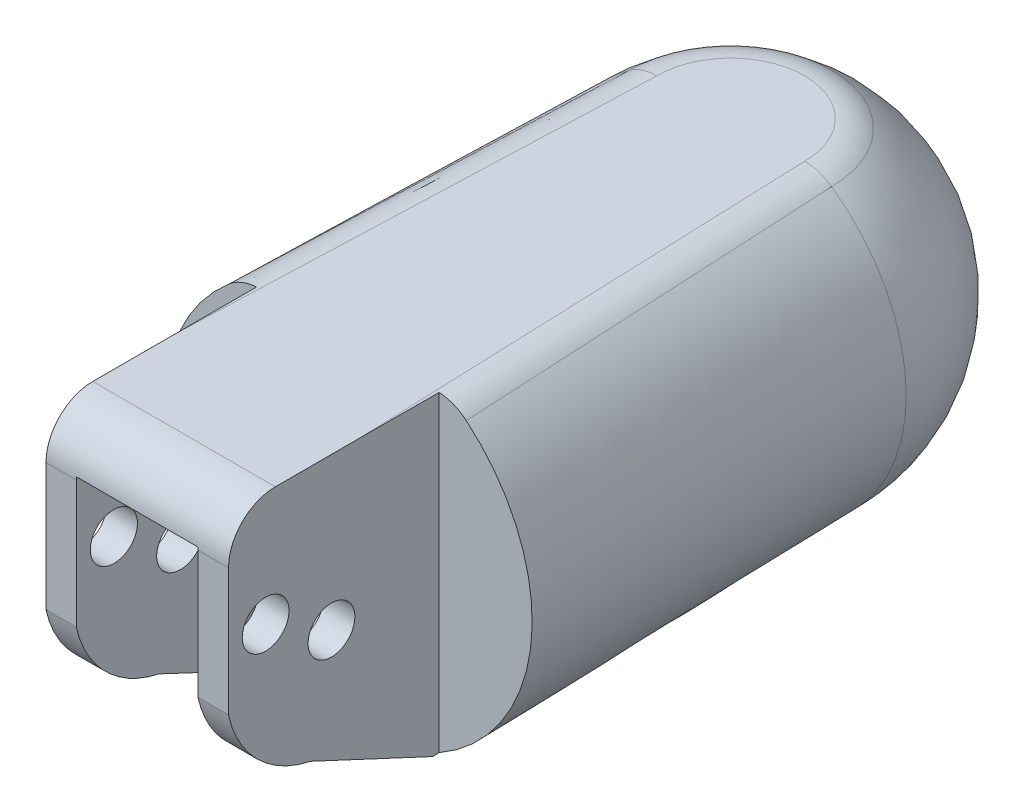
ISO-10303-21;
HEADER;
FILE_DESCRIPTION(('STEP AP214'),'2;1');
FILE_NAME('part.step','',(''),(''),'','','');
FILE_SCHEMA(('AUTOMOTIVE_DESIGN { 1 0 10303 214 1 1 1 1 }'));
ENDSEC;
DATA;
#1=APPLICATION_CONTEXT('core data for automotive mechanical design processes');
#2=APPLICATION_PROTOCOL_DEFINITION('international standard','automotive_design',2000,#1);
#3=PRODUCT_CONTEXT('',#1,'mechanical');
#4=PRODUCT('Part','Part','',(#3));
#5=PRODUCT_RELATED_PRODUCT_CATEGORY('part','',(#4));
#6=PRODUCT_DEFINITION_FORMATION('','',#4);
#7=PRODUCT_DEFINITION_CONTEXT('part definition',#1,'design');
#8=PRODUCT_DEFINITION('design','',#6,#7);
#9=PRODUCT_DEFINITION_SHAPE('','',#8);
#10=(LENGTH_UNIT() NAMED_UNIT(*) SI_UNIT(.MILLI.,.METRE.));
#11=(NAMED_UNIT(*) PLANE_ANGLE_UNIT() SI_UNIT($,.RADIAN.));
#12=(NAMED_UNIT(*) SI_UNIT($,.STERADIAN.) SOLID_ANGLE_UNIT());
#13=UNCERTAINTY_MEASURE_WITH_UNIT(LENGTH_MEASURE(1.E-05),#10,'distance_accuracy_value','');
#14=(GEOMETRIC_REPRESENTATION_CONTEXT(3) GLOBAL_UNCERTAINTY_ASSIGNED_CONTEXT((#13)) GLOBAL_UNIT_ASSIGNED_CONTEXT((#10,
#11,#12)) REPRESENTATION_CONTEXT('',''));
#15=CARTESIAN_POINT('',(0.,0.,0.));
#16=DIRECTION('',(0.,0.,1.));
#17=DIRECTION('',(1.,0.,0.));
#18=AXIS2_PLACEMENT_3D('',#15,#16,#17);
#19=CARTESIAN_POINT('',(-4.,-9.0001,-63.3906999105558));
#20=DIRECTION('',(0.,0.,-1.));
#21=DIRECTION('',(-1.,0.,0.));
#22=AXIS2_PLACEMENT_3D('',#19,#20,#21);
#23=PLANE('',#22);
#24=DIRECTION('',(-1.,0.,0.));
#25=VECTOR('',#24,1.);
#26=CARTESIAN_POINT('',(-3.9,4.5,-63.3906999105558));
#27=LINE('',#26,#25);
#28=CARTESIAN_POINT('',(3.9,4.5,-63.3906999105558));
#29=VERTEX_POINT('',#28);
#30=CARTESIAN_POINT('',(2.59822884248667,4.5,-63.3906999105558));
#31=VERTEX_POINT('',#30);
#32=EDGE_CURVE('E701',#29,#31,#27,.T.);
#33=ORIENTED_EDGE('',*,*,#32,.T.);
#34=DIRECTION('',(0.,-1.,0.));
#35=VECTOR('',#34,1.);
#36=CARTESIAN_POINT('',(2.59822884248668,-9.0001,-63.3906999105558));
#37=LINE('',#36,#35);
#38=CARTESIAN_POINT('',(2.59822884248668,-0.943398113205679,-63.3906999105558));
#39=VERTEX_POINT('',#38);
#40=EDGE_CURVE('E274',#31,#39,#37,.T.);
#41=ORIENTED_EDGE('',*,*,#40,.T.);
#42=DIRECTION('',(1.,0.,0.));
#43=VECTOR('',#42,1.);
#44=CARTESIAN_POINT('',(-12.3558277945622,-0.943398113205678,-63.3906999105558));
#45=LINE('',#44,#43);
#46=CARTESIAN_POINT('',(3.9,-0.943398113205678,-63.3906999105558));
#47=VERTEX_POINT('',#46);
#48=EDGE_CURVE('E324',#47,#39,#45,.F.);
#49=ORIENTED_EDGE('',*,*,#48,.F.);
#50=DIRECTION('',(0.,1.,0.));
#51=VECTOR('',#50,1.);
#52=CARTESIAN_POINT('',(3.9,-9.0001,-63.3906999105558));
#53=LINE('',#52,#51);
#54=EDGE_CURVE('E472',#47,#29,#53,.T.);
#55=ORIENTED_EDGE('',*,*,#54,.T.);
#56=EDGE_LOOP('',(#33,#41,#49,#55));
#57=FACE_BOUND('',#56,.T.);
#58=ADVANCED_FACE('F39',(#57),#23,.F.);
#59=CARTESIAN_POINT('',(-12.3558277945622,0.,-67.7906999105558));
#60=DIRECTION('',(1.,0.,0.));
#61=DIRECTION('',(0.,0.,-1.));
#62=AXIS2_PLACEMENT_3D('',#59,#60,#61);
#63=CYLINDRICAL_SURFACE('',#62,4.5);
#64=CARTESIAN_POINT('',(2.56383899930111,0.,-67.7906999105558));
#65=DIRECTION('',(0.999969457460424,0.,-0.00781563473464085));
#66=DIRECTION('',(0.00781563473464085,0.,0.999969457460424));
#67=AXIS2_PLACEMENT_3D('',#64,#65,#66);
#68=ELLIPSE('',#67,4.50013744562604,4.5);
#69=CARTESIAN_POINT('',(2.57087986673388,-4.40890957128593,-66.8898578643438));
#70=VERTEX_POINT('',#69);
#71=EDGE_CURVE('E277',#70,#39,#68,.F.);
#72=ORIENTED_EDGE('',*,*,#71,.F.);
#73=DIRECTION('',(1.,0.,0.));
#74=VECTOR('',#73,1.);
#75=CARTESIAN_POINT('',(-12.3558277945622,-4.40890957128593,-66.8898578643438));
#76=LINE('',#75,#74);
#77=CARTESIAN_POINT('',(3.9,-4.40890957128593,-66.8898578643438));
#78=VERTEX_POINT('',#77);
#79=EDGE_CURVE('E287',#70,#78,#76,.T.);
#80=ORIENTED_EDGE('',*,*,#79,.T.);
#81=CARTESIAN_POINT('',(3.9,0.,-67.7906999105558));
#82=DIRECTION('',(-1.,0.,0.));
#83=DIRECTION('',(0.,0.,1.));
#84=AXIS2_PLACEMENT_3D('',#81,#82,#83);
#85=CIRCLE('',#84,4.5);
#86=EDGE_CURVE('E698',#78,#47,#85,.T.);
#87=ORIENTED_EDGE('',*,*,#86,.T.);
#88=ORIENTED_EDGE('',*,*,#48,.T.);
#89=EDGE_LOOP('',(#72,#80,#87,#88));
#90=FACE_BOUND('',#89,.T.);
#91=ADVANCED_FACE('F644',(#90),#63,.T.);
#92=CARTESIAN_POINT('',(-3.9,-9.0001,-63.2906999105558));
#93=DIRECTION('',(1.,0.,0.));
#94=DIRECTION('',(0.,0.,-1.));
#95=AXIS2_PLACEMENT_3D('',#92,#93,#94);
#96=PLANE('',#95);
#97=CARTESIAN_POINT('',(-3.9,1.62499999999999,-64.9761173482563));
#98=DIRECTION('',(1.,0.,0.));
#99=DIRECTION('',(0.,0.,-1.));
#100=AXIS2_PLACEMENT_3D('',#97,#98,#99);
#101=CIRCLE('',#100,1.00000000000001);
#102=CARTESIAN_POINT('',(-3.9,1.62499999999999,-65.9761173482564));
#103=VERTEX_POINT('',#102);
#104=EDGE_CURVE('E237',#103,#103,#101,.T.);
#105=ORIENTED_EDGE('',*,*,#104,.T.);
#106=EDGE_LOOP('',(#105));
#107=FACE_BOUND('',#106,.T.);
#108=CARTESIAN_POINT('',(-3.9,0.,-67.7906999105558));
#109=DIRECTION('',(1.,0.,0.));
#110=DIRECTION('',(0.,0.,-1.));
#111=AXIS2_PLACEMENT_3D('',#108,#109,#110);
#112=CIRCLE('',#111,0.999999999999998);
#113=CARTESIAN_POINT('',(-3.9,0.,-68.7906999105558));
#114=VERTEX_POINT('',#113);
#115=EDGE_CURVE('E242',#114,#114,#112,.T.);
#116=ORIENTED_EDGE('',*,*,#115,.T.);
#117=EDGE_LOOP('',(#116));
#118=FACE_BOUND('',#117,.T.);
#119=DIRECTION('',(0.,1.,0.));
#120=VECTOR('',#119,1.);
#121=CARTESIAN_POINT('',(-3.9,-9.0001,-63.3906999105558));
#122=LINE('',#121,#120);
#123=CARTESIAN_POINT('',(-3.9,-0.943398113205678,-63.3906999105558));
#124=VERTEX_POINT('',#123);
#125=CARTESIAN_POINT('',(-3.9,4.5,-63.3906999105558));
#126=VERTEX_POINT('',#125);
#127=EDGE_CURVE('E460',#124,#126,#122,.T.);
#128=ORIENTED_EDGE('',*,*,#127,.T.);
#129=CARTESIAN_POINT('',(-3.9,4.5,-65.3906999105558));
#130=DIRECTION('',(1.,0.,0.));
#131=DIRECTION('',(0.,0.,-1.));
#132=AXIS2_PLACEMENT_3D('',#129,#130,#131);
#133=CIRCLE('',#132,2.);
#134=CARTESIAN_POINT('',(-3.9,6.5,-65.3906999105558));
#135=VERTEX_POINT('',#134);
#136=EDGE_CURVE('E703',#126,#135,#133,.F.);
#137=ORIENTED_EDGE('',*,*,#136,.T.);
#138=DIRECTION('',(0.,0.,-1.));
#139=VECTOR('',#138,1.);
#140=CARTESIAN_POINT('',(-3.9,6.5,-88.7530402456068));
#141=LINE('',#140,#139);
#142=CARTESIAN_POINT('',(-3.9,6.5,-68.8273589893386));
#143=VERTEX_POINT('',#142);
#144=EDGE_CURVE('E466',#135,#143,#141,.T.);
#145=ORIENTED_EDGE('',*,*,#144,.T.);
#146=CARTESIAN_POINT('',(-3.96948813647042,6.5,-66.8316367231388));
#147=CARTESIAN_POINT('',(-4.72449348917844,6.5,-66.8578000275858));
#148=CARTESIAN_POINT('',(-5.29095302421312,6.00054442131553,-66.8774296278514));
#149=CARTESIAN_POINT('',(-3.90040073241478,6.5,-68.8248118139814));
#150=CARTESIAN_POINT('',(-4.64571858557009,6.49999999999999,-68.8476731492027));
#151=CARTESIAN_POINT('',(-5.20897295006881,6.01189080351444,-68.8705874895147));
#152=CARTESIAN_POINT('',(-3.83037689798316,6.5,-70.8179551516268));
#153=CARTESIAN_POINT('',(-4.56559546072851,6.49999999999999,-70.8405857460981));
#154=CARTESIAN_POINT('',(-5.1254626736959,6.02348107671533,-70.8637123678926));
#155=CARTESIAN_POINT('',(-3.6880488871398,6.5,-74.8041580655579));
#156=CARTESIAN_POINT('',(-4.40233895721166,6.5,-74.8265946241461));
#157=CARTESIAN_POINT('',(-4.95472755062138,6.04718584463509,-74.8498755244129));
#158=CARTESIAN_POINT('',(-3.6157447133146,6.5,-76.7972176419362));
#159=CARTESIAN_POINT('',(-4.31922633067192,6.50000000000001,-76.8194292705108));
#160=CARTESIAN_POINT('',(-4.86750270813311,6.05930033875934,-76.8429138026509));
#161=CARTESIAN_POINT('',(-3.52779754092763,6.5,-79.1771762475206));
#162=CARTESIAN_POINT('',(-4.21772980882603,6.5,-79.202601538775));
#163=CARTESIAN_POINT('',(-4.76073432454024,6.07410167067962,-79.2228450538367));
#164=CARTESIAN_POINT('',(-3.51344786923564,6.5,-79.5641231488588));
#165=CARTESIAN_POINT('',(-4.20118501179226,6.49999999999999,-79.5895276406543));
#166=CARTESIAN_POINT('',(-4.74329289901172,6.07651873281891,-79.6097874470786));
#167=CARTESIAN_POINT('',(-3.43926822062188,6.5,-81.5571107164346));
#168=CARTESIAN_POINT('',(-4.11570833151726,6.49999999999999,-81.5802856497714));
#169=CARTESIAN_POINT('',(-4.65301996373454,6.08902318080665,-81.6027514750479));
#170=CARTESIAN_POINT('',(-3.37858556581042,6.5,-83.1631198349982));
#171=CARTESIAN_POINT('',(-4.04558141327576,6.49999999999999,-83.1861381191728));
#172=CARTESIAN_POINT('',(-4.57880336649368,6.09928446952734,-83.2087405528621));
#173=CARTESIAN_POINT('',(-3.26635943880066,6.5,-86.0819191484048));
#174=CARTESIAN_POINT('',(-3.91556755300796,6.5,-86.1055634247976));
#175=CARTESIAN_POINT('',(-4.44078043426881,6.11828984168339,-86.1275012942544));
#176=CARTESIAN_POINT('',(-3.21516956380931,6.5,-87.3947229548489));
#177=CARTESIAN_POINT('',(-3.85618506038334,6.50000000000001,-87.4182592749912));
#178=CARTESIAN_POINT('',(-4.37754659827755,6.1269689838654,-87.4402869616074));
#179=CARTESIAN_POINT('',(-3.16317964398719,6.5,-88.7074952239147));
#180=CARTESIAN_POINT('',(-3.79569252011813,6.5,-88.7325489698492));
#181=CARTESIAN_POINT('',(-4.31302006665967,6.13578502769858,-88.7530402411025));
#182=CARTESIAN_POINT('',(-3.14971315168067,6.5,-89.0475098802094));
#183=CARTESIAN_POINT('',(-3.78004746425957,6.5,-89.0724361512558));
#184=CARTESIAN_POINT('',(-4.29630610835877,6.13806840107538,-89.0930499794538));
#185=CARTESIAN_POINT('',(-3.13618972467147,6.5,-89.3875222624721));
#186=CARTESIAN_POINT('',(-3.76432371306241,6.5,-89.4124304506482));
#187=CARTESIAN_POINT('',(-4.27950032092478,6.14036110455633,-89.43305738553));
#188=CARTESIAN_POINT('',(-3.10902900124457,6.5,-90.0675424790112));
#189=CARTESIAN_POINT('',(-3.73272905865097,6.5,-90.0924159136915));
#190=CARTESIAN_POINT('',(-4.24570508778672,6.14496517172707,-90.1130675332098));
#191=CARTESIAN_POINT('',(-3.09539170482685,6.5,-90.4075503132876));
#192=CARTESIAN_POINT('',(-3.71685831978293,6.5,-90.4324055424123));
#193=CARTESIAN_POINT('',(-4.22871564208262,6.14727653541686,-90.4530702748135));
#194=CARTESIAN_POINT('',(-3.0816974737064,6.5,-90.7475558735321));
#195=CARTESIAN_POINT('',(-3.70090930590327,6.5,-90.7724982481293));
#196=CARTESIAN_POINT('',(-4.21163436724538,6.14959722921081,-90.7930706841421));
#197=(BOUNDED_SURFACE() B_SPLINE_SURFACE(3,2,((#146,#147,#148),(#149,#150,#151),(#152,#153,
#154),(#155,#156,#157),(#158,#159,#160),(#161,#162,#163),(#164,#165,#166),(#167,#168,#169),
(#170,#171,#172),(#173,#174,#175),(#176,#177,#178),(#179,#180,#181),(#182,#183,#184),(#185,#186,
#187),(#188,#189,#190),(#191,#192,#193),(#194,#195,#196)),.UNSPECIFIED.,.F.,.F.,
.F.) B_SPLINE_SURFACE_WITH_KNOTS((4,2,2,2,2,3,2,4),(3,3),(0.,5.98311719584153,11.9662276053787,
13.1278662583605,17.9493302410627,21.8907338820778,22.9115775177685,23.9324211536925),(0.,1.),
.UNSPECIFIED.) GEOMETRIC_REPRESENTATION_ITEM() RATIONAL_B_SPLINE_SURFACE(((1.,0.935487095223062,
1.),(1.,0.93700318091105,1.),(1.,0.938548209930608,1.),(1.,0.941700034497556,1.),(1.,
0.943306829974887,1.),(1.,0.945264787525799,1.),(1.,0.945584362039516,1.),(1.,0.947236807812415,
1.),(1.,0.948590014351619,1.),(1.,0.951090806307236,1.),(1.,0.952230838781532,1.),(1.,
0.953386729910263,1.),(1.,0.953686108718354,1.),(1.,0.953986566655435,1.),(1.,0.954589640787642,
1.),(1.,0.954892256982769,1.),(1.,0.955195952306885,1.))) REPRESENTATION_ITEM('') SURFACE());
#198=CARTESIAN_POINT('',(-3.9,6.5,-68.8273589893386));
#199=CARTESIAN_POINT('',(-3.9,6.50000631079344,-69.4212498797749));
#200=CARTESIAN_POINT('',(-3.9,6.49967988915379,-70.0151404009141));
#201=CARTESIAN_POINT('',(-3.9,6.49836158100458,-71.2029207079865));
#202=CARTESIAN_POINT('',(-3.9,6.49736969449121,-71.7968104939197));
#203=CARTESIAN_POINT('',(-3.9,6.49604507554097,-72.3906999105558));
#204=B_SPLINE_CURVE_WITH_KNOTS('',3,(#198,#199,#200,#201,#202,#203),.UNSPECIFIED.,.F.,.F.,(4,2,
4),(0.,1.78167183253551,3.56334367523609),.UNSPECIFIED.);
#205=CARTESIAN_POINT('',(-3.9,6.49604507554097,-72.3906999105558));
#206=VERTEX_POINT('',#205);
#207=EDGE_CURVE('E468',#143,#206,#204,.T.);
#208=ORIENTED_EDGE('',*,*,#207,.T.);
#209=DIRECTION('',(0.,1.,0.));
#210=VECTOR('',#209,1.);
#211=CARTESIAN_POINT('',(-3.9,-9.0001,-72.3906999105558));
#212=LINE('',#211,#210);
#213=CARTESIAN_POINT('',(-3.9,-6.83924779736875,-72.3906999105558));
#214=VERTEX_POINT('',#213);
#215=EDGE_CURVE('E474',#214,#206,#212,.T.);
#216=ORIENTED_EDGE('',*,*,#215,.F.);
#217=CARTESIAN_POINT('',(-3.9,-6.83924779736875,-72.3906999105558));
#218=CARTESIAN_POINT('',(-3.9,-6.878684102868,-70.8907031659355));
#219=CARTESIAN_POINT('',(-3.9,-6.91805830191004,-69.3907047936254));
#220=CARTESIAN_POINT('',(-3.9,-6.9966824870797,-66.3907047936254));
#221=CARTESIAN_POINT('',(-3.9,-7.03593247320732,-64.8907031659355));
#222=CARTESIAN_POINT('',(-3.9,-7.07512035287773,-63.3906999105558));
#223=B_SPLINE_CURVE_WITH_KNOTS('',3,(#217,#218,#219,#220,#221,#222),.UNSPECIFIED.,.F.,.F.,(4,2,
4),(0.,4.50154517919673,9.00309035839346),.UNSPECIFIED.);
#224=CARTESIAN_POINT('',(-3.9,-6.84643918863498,-72.117156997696));
#225=VERTEX_POINT('',#224);
#226=EDGE_CURVE('E365',#214,#225,#223,.T.);
#227=ORIENTED_EDGE('',*,*,#226,.T.);
#228=DIRECTION('',(0.,0.422618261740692,0.906307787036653));
#229=VECTOR('',#228,1.);
#230=CARTESIAN_POINT('',(-3.9,-3.85036714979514,-65.6920597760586));
#231=LINE('',#230,#229);
#232=CARTESIAN_POINT('',(-3.9,-4.40890957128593,-66.8898578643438));
#233=VERTEX_POINT('',#232);
#234=EDGE_CURVE('E296',#225,#233,#231,.T.);
#235=ORIENTED_EDGE('',*,*,#234,.T.);
#236=CARTESIAN_POINT('',(-3.9,0.,-67.7906999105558));
#237=DIRECTION('',(1.,0.,0.));
#238=DIRECTION('',(0.,0.,-1.));
#239=AXIS2_PLACEMENT_3D('',#236,#237,#238);
#240=CIRCLE('',#239,4.5);
#241=EDGE_CURVE('E439',#124,#233,#240,.T.);
#242=ORIENTED_EDGE('',*,*,#241,.F.);
#243=EDGE_LOOP('',(#128,#137,#145,#208,#216,#227,#235,#242));
#244=FACE_BOUND('',#243,.T.);
#245=ADVANCED_FACE('F459',(#107,#118,#244),#96,.F.);
#246=CARTESIAN_POINT('',(-2.59822884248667,-0.943398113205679,-63.3906999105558));
#247=VERTEX_POINT('',#246);
#248=EDGE_CURVE('E323',#247,#124,#45,.F.);
#249=ORIENTED_EDGE('',*,*,#248,.F.);
#250=DIRECTION('',(0.,1.,0.));
#251=VECTOR('',#250,1.);
#252=CARTESIAN_POINT('',(-2.59822884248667,-9.0001,-63.3906999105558));
#253=LINE('',#252,#251);
#254=CARTESIAN_POINT('',(-2.59822884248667,4.5,-63.3906999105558));
#255=VERTEX_POINT('',#254);
#256=EDGE_CURVE('E737',#247,#255,#253,.T.);
#257=ORIENTED_EDGE('',*,*,#256,.T.);
#258=EDGE_CURVE('E464',#255,#126,#27,.T.);
#259=ORIENTED_EDGE('',*,*,#258,.T.);
#260=ORIENTED_EDGE('',*,*,#127,.F.);
#261=EDGE_LOOP('',(#249,#257,#259,#260));
#262=FACE_BOUND('',#261,.T.);
#263=ADVANCED_FACE('F462',(#262),#23,.F.);
#264=CARTESIAN_POINT('',(3.9,-9.0001,-63.2906999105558));
#265=DIRECTION('',(-1.,0.,0.));
#266=DIRECTION('',(0.,0.,1.));
#267=AXIS2_PLACEMENT_3D('',#264,#265,#266);
#268=PLANE('',#267);
#269=CARTESIAN_POINT('',(3.9,1.62499999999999,-64.9761173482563));
#270=DIRECTION('',(-1.,0.,0.));
#271=DIRECTION('',(0.,0.,1.));
#272=AXIS2_PLACEMENT_3D('',#269,#270,#271);
#273=CIRCLE('',#272,1.00000000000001);
#274=CARTESIAN_POINT('',(3.9,1.62499999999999,-63.9761173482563));
#275=VERTEX_POINT('',#274);
#276=EDGE_CURVE('E1107',#275,#275,#273,.T.);
#277=ORIENTED_EDGE('',*,*,#276,.T.);
#278=EDGE_LOOP('',(#277));
#279=FACE_BOUND('',#278,.T.);
#280=CARTESIAN_POINT('',(3.9,0.,-67.7906999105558));
#281=DIRECTION('',(-1.,0.,0.));
#282=DIRECTION('',(0.,0.,1.));
#283=AXIS2_PLACEMENT_3D('',#280,#281,#282);
#284=CIRCLE('',#283,0.999999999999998);
#285=CARTESIAN_POINT('',(3.9,0.,-66.7906999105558));
#286=VERTEX_POINT('',#285);
#287=EDGE_CURVE('E1112',#286,#286,#284,.T.);
#288=ORIENTED_EDGE('',*,*,#287,.T.);
#289=EDGE_LOOP('',(#288));
#290=FACE_BOUND('',#289,.T.);
#291=DIRECTION('',(0.,0.,1.));
#292=VECTOR('',#291,1.);
#293=CARTESIAN_POINT('',(3.9,6.5,-88.7530402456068));
#294=LINE('',#293,#292);
#295=CARTESIAN_POINT('',(3.89999999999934,6.5,-68.8273589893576));
#296=VERTEX_POINT('',#295);
#297=CARTESIAN_POINT('',(3.9,6.5,-65.3906999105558));
#298=VERTEX_POINT('',#297);
#299=EDGE_CURVE('E750',#296,#298,#294,.T.);
#300=ORIENTED_EDGE('',*,*,#299,.T.);
#301=CARTESIAN_POINT('',(3.9,4.5,-65.3906999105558));
#302=DIRECTION('',(-1.,0.,0.));
#303=DIRECTION('',(0.,0.,1.));
#304=AXIS2_PLACEMENT_3D('',#301,#302,#303);
#305=CIRCLE('',#304,2.);
#306=EDGE_CURVE('E707',#298,#29,#305,.F.);
#307=ORIENTED_EDGE('',*,*,#306,.T.);
#308=ORIENTED_EDGE('',*,*,#54,.F.);
#309=ORIENTED_EDGE('',*,*,#86,.F.);
#310=DIRECTION('',(0.,-0.422618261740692,-0.906307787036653));
#311=VECTOR('',#310,1.);
#312=CARTESIAN_POINT('',(3.9,-3.85036714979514,-65.6920597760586));
#313=LINE('',#312,#311);
#314=CARTESIAN_POINT('',(3.9,-6.84643918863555,-72.1171569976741));
#315=VERTEX_POINT('',#314);
#316=EDGE_CURVE('E693',#78,#315,#313,.T.);
#317=ORIENTED_EDGE('',*,*,#316,.T.);
#318=CARTESIAN_POINT('',(3.9,-7.07512035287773,-63.3906999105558));
#319=CARTESIAN_POINT('',(3.9,-7.03593247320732,-64.8907031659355));
#320=CARTESIAN_POINT('',(3.9,-6.9966824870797,-66.3907047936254));
#321=CARTESIAN_POINT('',(3.9,-6.91805830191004,-69.3907047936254));
#322=CARTESIAN_POINT('',(3.9,-6.878684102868,-70.8907031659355));
#323=CARTESIAN_POINT('',(3.9,-6.83924779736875,-72.3906999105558));
#324=B_SPLINE_CURVE_WITH_KNOTS('',3,(#318,#319,#320,#321,#322,#323),.UNSPECIFIED.,.F.,.F.,(4,2,
4),(0.,4.50154517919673,9.00309035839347),.UNSPECIFIED.);
#325=CARTESIAN_POINT('',(3.9,-6.83924779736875,-72.3906999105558));
#326=VERTEX_POINT('',#325);
#327=EDGE_CURVE('E757',#315,#326,#324,.T.);
#328=ORIENTED_EDGE('',*,*,#327,.T.);
#329=DIRECTION('',(0.,1.,0.));
#330=VECTOR('',#329,1.);
#331=CARTESIAN_POINT('',(3.9,-9.0001,-72.3906999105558));
#332=LINE('',#331,#330);
#333=CARTESIAN_POINT('',(3.9,6.49604507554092,-72.3906999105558));
#334=VERTEX_POINT('',#333);
#335=EDGE_CURVE('E775',#326,#334,#332,.T.);
#336=ORIENTED_EDGE('',*,*,#335,.T.);
#337=CARTESIAN_POINT('',(2.7478306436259,6.5,-98.7337813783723));
#338=CARTESIAN_POINT('',(3.31070414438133,6.5,-98.7582732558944));
#339=CARTESIAN_POINT('',(3.79081031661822,6.20591144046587,-98.7791637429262));
#340=CARTESIAN_POINT('',(2.78418000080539,6.5,-97.8983302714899));
#341=CARTESIAN_POINT('',(3.35338415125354,6.5,-97.9221846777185));
#342=CARTESIAN_POINT('',(3.83711251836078,6.19982504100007,-97.9437277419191));
#343=CARTESIAN_POINT('',(2.82003406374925,6.5,-97.0628577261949));
#344=CARTESIAN_POINT('',(3.39539403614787,6.5,-97.0867713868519));
#345=CARTESIAN_POINT('',(3.88262319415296,6.19380191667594,-97.1082698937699));
#346=CARTESIAN_POINT('',(2.89084573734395,6.5,-95.3918754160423));
#347=CARTESIAN_POINT('',(3.47826683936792,6.5,-95.4158827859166));
#348=CARTESIAN_POINT('',(3.97220840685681,6.18187822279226,-95.4373161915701));
#349=CARTESIAN_POINT('',(2.92580334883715,6.5,-94.5563656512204));
#350=CARTESIAN_POINT('',(3.51912668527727,6.5,-94.5804318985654));
#351=CARTESIAN_POINT('',(4.01628294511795,6.17597765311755,-94.6018203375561));
#352=CARTESIAN_POINT('',(2.99491632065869,6.5,-92.8853130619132));
#353=CARTESIAN_POINT('',(3.59981766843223,6.5,-92.9094718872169));
#354=CARTESIAN_POINT('',(4.10314287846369,6.16429506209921,-92.9307948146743));
#355=CARTESIAN_POINT('',(3.02907168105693,6.5,-92.0497702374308));
#356=CARTESIAN_POINT('',(3.63964601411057,6.5,-92.0739865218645));
#357=CARTESIAN_POINT('',(4.14592827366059,6.15851304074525,-92.0952651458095));
#358=CARTESIAN_POINT('',(3.09665375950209,6.5,-90.378654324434));
#359=CARTESIAN_POINT('',(3.71836594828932,6.5,-90.4029620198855));
#360=CARTESIAN_POINT('',(4.23032548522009,6.1470638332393,-90.4241748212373));
#361=CARTESIAN_POINT('',(3.1300804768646,6.5,-89.5430812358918));
#362=CARTESIAN_POINT('',(3.75725497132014,6.5,-89.5674460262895));
#363=CARTESIAN_POINT('',(4.27193730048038,6.14139664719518,-89.5886141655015));
#364=CARTESIAN_POINT('',(3.16317964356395,6.5,-88.7074952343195));
#365=CARTESIAN_POINT('',(3.79569251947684,6.5,-88.7325489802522));
#366=CARTESIAN_POINT('',(4.3130200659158,6.13578502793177,-88.7530402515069));
#367=CARTESIAN_POINT('',(3.16984529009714,6.5,-88.5392064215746));
#368=CARTESIAN_POINT('',(3.80344028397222,6.5,-88.5642432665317));
#369=CARTESIAN_POINT('',(4.32129330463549,6.1346548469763,-88.5847538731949));
#370=CARTESIAN_POINT('',(3.17649778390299,6.5,-88.3709170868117));
#371=CARTESIAN_POINT('',(3.8111698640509,6.5,-88.3959631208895));
#372=CARTESIAN_POINT('',(4.32954529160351,6.13352691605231,-88.4164669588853));
#373=CARTESIAN_POINT('',(3.32926138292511,6.5,-84.4988662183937));
#374=CARTESIAN_POINT('',(3.98920823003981,6.5,-84.5114717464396));
#375=CARTESIAN_POINT('',(4.5189264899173,6.10762670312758,-84.544471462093));
#376=CARTESIAN_POINT('',(3.46910190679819,6.5,-80.7948564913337));
#377=CARTESIAN_POINT('',(4.15074247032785,6.5,-80.8085384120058));
#378=CARTESIAN_POINT('',(4.689921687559,6.08393585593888,-80.8405079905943));
#379=CARTESIAN_POINT('',(3.740051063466,6.5,-73.3865168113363));
#380=CARTESIAN_POINT('',(4.46257080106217,6.5,-73.4005026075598));
#381=CARTESIAN_POINT('',(5.01770134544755,6.03845043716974,-73.4322501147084));
#382=CARTESIAN_POINT('',(3.87115968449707,6.5,-69.6821868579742));
#383=CARTESIAN_POINT('',(4.6127186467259,6.49999999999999,-69.6971440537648));
#384=CARTESIAN_POINT('',(5.17448578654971,6.01665586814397,-69.7279557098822));
#385=CARTESIAN_POINT('',(4.12687899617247,6.49999999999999,-62.2732939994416));
#386=CARTESIAN_POINT('',(4.90457137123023,6.5,-62.288536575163));
#387=CARTESIAN_POINT('',(5.47744630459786,5.97474165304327,-62.3191255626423));
#388=CARTESIAN_POINT('',(4.25148967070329,6.49999999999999,-58.5687310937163));
#389=CARTESIAN_POINT('',(5.04616285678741,6.5,-58.5848616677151));
#390=CARTESIAN_POINT('',(5.62362235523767,5.95462201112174,-58.6145898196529));
#391=CARTESIAN_POINT('',(4.49569086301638,6.49999999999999,-51.1594398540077));
#392=CARTESIAN_POINT('',(5.32276550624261,6.49999999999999,-51.1758416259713));
#393=CARTESIAN_POINT('',(5.90777081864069,5.91587256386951,-51.2053463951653));
#394=CARTESIAN_POINT('',(4.61528137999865,6.49999999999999,-47.4547115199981));
#395=CARTESIAN_POINT('',(5.45768564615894,6.49999999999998,-47.4719255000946));
#396=CARTESIAN_POINT('',(6.04574323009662,5.89724275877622,-47.5006387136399));
#397=CARTESIAN_POINT('',(4.791047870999,6.49999999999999,-41.9168611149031));
#398=CARTESIAN_POINT('',(5.65513539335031,6.49999999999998,-41.9417181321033));
#399=CARTESIAN_POINT('',(6.24709186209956,5.87039181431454,-41.9628154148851));
#400=CARTESIAN_POINT('',(4.84873701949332,6.49999999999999,-40.0837868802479));
#401=CARTESIAN_POINT('',(5.71991761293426,6.49999999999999,-40.1087903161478));
#402=CARTESIAN_POINT('',(6.31293852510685,5.86166721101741,-40.1297495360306));
#403=CARTESIAN_POINT('',(4.96322439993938,6.49999999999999,-36.4176128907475));
#404=CARTESIAN_POINT('',(5.84828905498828,6.49999999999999,-36.4427641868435));
#405=CARTESIAN_POINT('',(6.44317877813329,5.84452808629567,-36.4635911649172));
#406=CARTESIAN_POINT('',(5.02002263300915,6.49999999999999,-34.5845131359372));
#407=CARTESIAN_POINT('',(5.91186990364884,6.49999999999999,-34.6098173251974));
#408=CARTESIAN_POINT('',(6.50757236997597,5.83611356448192,-34.6304986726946));
#409=CARTESIAN_POINT('',(5.30202519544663,6.49999999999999,-25.4189435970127));
#410=CARTESIAN_POINT('',(6.22828864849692,6.49999999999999,-25.4102190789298));
#411=CARTESIAN_POINT('',(6.82630093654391,5.79477354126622,-25.4649630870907));
#412=CARTESIAN_POINT('',(5.52126282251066,6.49999999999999,-18.0862900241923));
#413=CARTESIAN_POINT('',(6.47164657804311,6.49999999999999,-18.0819699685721));
#414=CARTESIAN_POINT('',(7.07091671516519,5.76404593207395,-18.1323291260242));
#415=CARTESIAN_POINT('',(5.9508180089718,6.49999999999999,-3.42071822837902));
#416=CARTESIAN_POINT('',(6.94649469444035,6.49999999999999,-3.41668273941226));
#417=CARTESIAN_POINT('',(7.5457271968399,5.70642751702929,-3.46678759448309));
#418=CARTESIAN_POINT('',(6.16113556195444,6.49999999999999,3.91219999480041));
#419=CARTESIAN_POINT('',(7.17762238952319,6.49999999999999,3.91253164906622));
#420=CARTESIAN_POINT('',(7.77592188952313,5.67953671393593,3.86611997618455));
#421=CARTESIAN_POINT('',(6.40953851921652,6.49999999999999,12.7120187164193));
#422=CARTESIAN_POINT('',(7.44872548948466,6.49999999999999,12.6839199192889));
#423=CARTESIAN_POINT('',(8.04578439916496,5.64917905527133,12.6659291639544));
#424=CARTESIAN_POINT('',(6.45081099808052,6.49999999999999,14.1788296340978));
#425=CARTESIAN_POINT('',(7.49387320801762,6.49999999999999,14.1506609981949));
#426=CARTESIAN_POINT('',(8.09055408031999,5.64418260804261,14.1327386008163));
#427=CARTESIAN_POINT('',(6.53310272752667,6.49999999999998,17.1124579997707));
#428=CARTESIAN_POINT('',(7.58381603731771,6.49999999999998,17.0842018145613));
#429=CARTESIAN_POINT('',(8.17968881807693,5.63431306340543,17.0663642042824));
#430=CARTESIAN_POINT('',(6.57412197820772,6.49999999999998,18.5792754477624));
#431=CARTESIAN_POINT('',(7.628608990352,6.49999999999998,18.5509493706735));
#432=CARTESIAN_POINT('',(8.22405387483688,5.6294399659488,18.5331803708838));
#433=CARTESIAN_POINT('',(6.61502085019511,6.49999999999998,20.0460962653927));
#434=CARTESIAN_POINT('',(7.67319924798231,6.49999999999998,20.0165911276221));
#435=CARTESIAN_POINT('',(8.26822696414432,5.62462646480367,19.9999999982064));
#436=CARTESIAN_POINT('',(6.69680282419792,6.49999999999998,22.9792228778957));
#437=CARTESIAN_POINT('',(7.76256775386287,6.49999999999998,22.9541256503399));
#438=CARTESIAN_POINT('',(8.35655526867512,5.6150014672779,22.9331242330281));
#439=CARTESIAN_POINT('',(6.77811018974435,6.49999999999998,25.91236269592));
#440=CARTESIAN_POINT('',(7.85112599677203,6.49999999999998,25.8870030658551));
#441=CARTESIAN_POINT('',(8.44412725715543,5.60561340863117,25.866262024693));
#442=CARTESIAN_POINT('',(6.93986138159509,6.49999999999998,31.7786659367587));
#443=CARTESIAN_POINT('',(8.02703709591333,6.49999999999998,31.7531529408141));
#444=CARTESIAN_POINT('',(8.61790065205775,5.58728090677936,31.7325618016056));
#445=CARTESIAN_POINT('',(7.0203052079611,6.49999999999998,34.7118293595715));
#446=CARTESIAN_POINT('',(8.1143748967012,6.49999999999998,34.686043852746));
#447=CARTESIAN_POINT('',(8.7041020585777,5.57833646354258,34.6657237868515));
#448=CARTESIAN_POINT('',(7.18041500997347,6.49999999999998,40.5781773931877));
#449=CARTESIAN_POINT('',(8.28796039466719,6.49999999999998,40.5522302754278));
#450=CARTESIAN_POINT('',(8.87527635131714,5.56086092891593,40.5320694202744));
#451=CARTESIAN_POINT('',(7.26008098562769,6.49999999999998,43.511362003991));
#452=CARTESIAN_POINT('',(8.37419431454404,6.49999999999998,43.4851665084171));
#453=CARTESIAN_POINT('',(8.96024923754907,5.55232983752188,43.4652530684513));
#454=CARTESIAN_POINT('',(7.41870444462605,6.49999999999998,49.3777505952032));
#455=CARTESIAN_POINT('',(8.54566283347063,6.49999999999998,49.3513889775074));
#456=CARTESIAN_POINT('',(9.12908116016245,5.53565450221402,49.3316401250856));
#457=CARTESIAN_POINT('',(7.49766192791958,6.49999999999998,52.3109545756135));
#458=CARTESIAN_POINT('',(8.63088473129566,6.49999999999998,52.284335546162));
#459=CARTESIAN_POINT('',(9.21294019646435,5.52751025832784,52.2648435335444));
#460=CARTESIAN_POINT('',(7.57629983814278,6.49999999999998,55.2441671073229));
#461=CARTESIAN_POINT('',(8.71554374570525,6.49999999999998,55.2136251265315));
#462=CARTESIAN_POINT('',(9.29629963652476,5.51954618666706,55.198055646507));
#463=(BOUNDED_SURFACE() B_SPLINE_SURFACE(3,2,((#337,#338,#339),(#340,#341,#342),(#343,#344,
#345),(#346,#347,#348),(#349,#350,#351),(#352,#353,#354),(#355,#356,#357),(#358,#359,#360),
(#361,#362,#363),(#364,#365,#366),(#367,#368,#369),(#370,#371,#372),(#373,#374,#375),(#376,#377,
#378),(#379,#380,#381),(#382,#383,#384),(#385,#386,#387),(#388,#389,#390),(#391,#392,#393),
(#394,#395,#396),(#397,#398,#399),(#400,#401,#402),(#403,#404,#405),(#406,#407,#408),(#409,#410,
#411),(#412,#413,#414),(#415,#416,#417),(#418,#419,#420),(#421,#422,#423),(#424,#425,#426),
(#427,#428,#429),(#430,#431,#432),(#433,#434,#435),(#436,#437,#438),(#439,#440,#441),(#442,#443,
#444),(#445,#446,#447),(#448,#449,#450),(#451,#452,#453),(#454,#455,#456),(#457,#458,#459),
(#460,#461,#462)),.UNSPECIFIED.,.F.,.F.,.F.) B_SPLINE_SURFACE_WITH_KNOTS((4,2,2,2,3,2,2,2,2,2,2,
2,2,2,2,3,2,2,2,4),(3,3),(0.,2.5087241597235,5.01744596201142,7.52616754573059,10.0348914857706,
10.5401537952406,21.660080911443,32.780023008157,43.8999926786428,55.0199641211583,
60.5219092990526,66.0238475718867,88.0316291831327,110.039426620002,114.441600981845,
118.843773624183,127.646573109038,136.449371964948,145.252170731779,154.054970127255),(0.,1.),
.UNSPECIFIED.) GEOMETRIC_REPRESENTATION_ITEM() RATIONAL_B_SPLINE_SURFACE(((1.,0.96253719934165,
1.),(1.,0.961746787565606,1.),(1.,0.960963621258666,1.),(1.,0.95941136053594,1.),(1.,
0.95864226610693,1.),(1.,0.957117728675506,1.),(1.,0.956362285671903,1.),(1.,0.954864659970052,
1.),(1.,0.954122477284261,1.),(1.,0.953386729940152,1.),(1.,0.953238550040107,1.),(1.,
0.953090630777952,1.),(1.,0.949693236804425,1.),(1.,0.946569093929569,1.),(1.,0.940543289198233,
1.),(1.,0.937641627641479,1.),(1.,0.932037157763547,1.),(1.,0.929334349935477,1.),(1.,
0.924107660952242,1.),(1.,0.921583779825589,1.),(1.,0.91793213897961,1.),(1.,0.91674324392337,
1.),(1.,0.914403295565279,1.),(1.,0.913252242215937,1.),(1.,0.90758690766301,1.),(1.,
0.903342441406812,1.),(1.,0.895333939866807,1.),(1.,0.891569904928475,1.),(1.,0.88729660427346,
1.),(1.,0.886592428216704,1.),(1.,0.885199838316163,1.),(1.,0.884511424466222,1.),(1.,
0.883830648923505,1.),(1.,0.882469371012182,1.),(1.,0.881138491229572,1.),(1.,0.878533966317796,
1.),(1.,0.877260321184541,1.),(1.,0.874766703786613,1.),(1.,0.873546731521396,1.),(1.,
0.871157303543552,1.),(1.,0.869987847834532,1.),(1.,0.868842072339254,1.))) REPRESENTATION_ITEM('') SURFACE());
#464=CARTESIAN_POINT('',(3.9,6.49604507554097,-72.3906999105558));
#465=CARTESIAN_POINT('',(3.9,6.49736993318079,-71.796810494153));
#466=CARTESIAN_POINT('',(3.9,6.49836193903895,-71.2029207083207));
#467=CARTESIAN_POINT('',(3.9,6.49968024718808,-70.0151404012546));
#468=CARTESIAN_POINT('',(3.9,6.50000654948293,-69.4212498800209));
#469=CARTESIAN_POINT('',(3.9,6.49999999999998,-68.8273589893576));
#470=B_SPLINE_CURVE_WITH_KNOTS('',3,(#464,#465,#466,#467,#468,#469),.UNSPECIFIED.,.F.,.F.,(4,2,
4),(0.,1.78167184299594,3.56334367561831),.UNSPECIFIED.);
#471=EDGE_CURVE('E507',#334,#296,#470,.T.);
#472=ORIENTED_EDGE('',*,*,#471,.T.);
#473=EDGE_LOOP('',(#300,#307,#308,#309,#317,#328,#336,#472));
#474=FACE_BOUND('',#473,.T.);
#475=ADVANCED_FACE('F652',(#279,#290,#474),#268,.F.);
#476=CARTESIAN_POINT('',(3.74165738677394,-6.5,-88.7530402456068));
#477=CARTESIAN_POINT('',(4.35889894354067,-9.,20.));
#478=CARTESIAN_POINT('',(9.38126392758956,-3.25361915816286,-88.7530402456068));
#479=CARTESIAN_POINT('',(13.0137632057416,-4.80825792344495,20.));
#480=CARTESIAN_POINT('',(9.38126392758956,3.25361915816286,-88.7530402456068));
#481=CARTESIAN_POINT('',(13.0137632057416,4.80825792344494,20.));
#482=CARTESIAN_POINT('',(3.74165738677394,6.5,-88.7530402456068));
#483=CARTESIAN_POINT('',(4.35889894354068,9.,20.));
#484=(BOUNDED_SURFACE() B_SPLINE_SURFACE(3,1,((#476,#477),(#478,#479),(#480,#481),(#482,#483)),
.UNSPECIFIED.,.F.,.F.,.F.) B_SPLINE_SURFACE_WITH_KNOTS((4,4),(2,2),(0.,1.),(0.,1.),
.UNSPECIFIED.) GEOMETRIC_REPRESENTATION_ITEM() RATIONAL_B_SPLINE_SURFACE(((1.,1.),
(0.665925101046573,0.623926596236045),(0.665925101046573,0.623926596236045),(1.,1.))) REPRESENTATION_ITEM('') SURFACE());
#485=CARTESIAN_POINT('',(3.83565903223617,-6.88073281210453,-72.1906999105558));
#486=CARTESIAN_POINT('',(3.89888718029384,-6.84738895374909,-72.119193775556));
#487=CARTESIAN_POINT('',(3.9608984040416,-6.81363845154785,-72.0468155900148));
#488=CARTESIAN_POINT('',(4.08259857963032,-6.74540407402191,-71.9004864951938));
#489=CARTESIAN_POINT('',(4.14228783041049,-6.71092029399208,-71.8265357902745));
#490=CARTESIAN_POINT('',(4.31770784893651,-6.60668737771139,-71.6030075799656));
#491=CARTESIAN_POINT('',(4.43017361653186,-6.53595310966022,-71.4513174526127));
#492=CARTESIAN_POINT('',(4.64704129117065,-6.39243938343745,-71.1435512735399));
#493=CARTESIAN_POINT('',(4.75145230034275,-6.31966236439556,-70.9874804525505));
#494=CARTESIAN_POINT('',(4.95305372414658,-6.1723620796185,-70.671593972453));
#495=CARTESIAN_POINT('',(5.05024516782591,-6.09783906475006,-70.5117788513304));
#496=CARTESIAN_POINT('',(5.23707334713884,-5.94809771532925,-70.1906574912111));
#497=CARTESIAN_POINT('',(5.32677714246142,-5.87289427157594,-70.0293831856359));
#498=CARTESIAN_POINT('',(5.50028345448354,-5.72123396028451,-69.7041465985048));
#499=CARTESIAN_POINT('',(5.58408274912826,-5.64477643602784,-69.5401829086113));
#500=CARTESIAN_POINT('',(5.74619372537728,-5.49080458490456,-69.2099892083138));
#501=CARTESIAN_POINT('',(5.82450376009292,-5.41328994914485,-69.0437585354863));
#502=CARTESIAN_POINT('',(5.97597959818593,-5.25738646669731,-68.709422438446));
#503=CARTESIAN_POINT('',(6.04914636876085,-5.17899778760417,-68.5413173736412));
#504=CARTESIAN_POINT('',(6.17094856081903,-5.0434200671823,-68.2505700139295));
#505=CARTESIAN_POINT('',(6.22073523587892,-4.98641488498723,-68.1283220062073));
#506=CARTESIAN_POINT('',(6.31791036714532,-4.87206038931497,-67.8830879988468));
#507=CARTESIAN_POINT('',(6.36529955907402,-4.81471118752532,-67.7601022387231));
#508=CARTESIAN_POINT('',(6.45797171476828,-4.69946872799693,-67.512963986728));
#509=CARTESIAN_POINT('',(6.50324605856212,-4.64157423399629,-67.3888088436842));
#510=CARTESIAN_POINT('',(6.59160049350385,-4.52546821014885,-67.1398186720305));
#511=CARTESIAN_POINT('',(6.63467994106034,-4.46725659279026,-67.014983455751));
#512=CARTESIAN_POINT('',(6.6767006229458,-4.40890957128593,-66.8898578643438));
#513=B_SPLINE_CURVE_WITH_KNOTS('',3,(#485,#486,#487,#488,#489,#490,#491,#492,#493,#494,#495,
#496,#497,#498,#499,#500,#501,#502,#503,#504,#505,#506,#507,#508,#509,#510,#511,#512),
.UNSPECIFIED.,.F.,.F.,(4,2,2,2,2,2,2,2,2,2,2,2,2,4),(0.,0.303293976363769,0.606548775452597,
1.21121530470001,1.81518821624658,2.41907487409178,3.01678958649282,3.61482798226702,
4.21304504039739,4.81114930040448,5.24246994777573,5.67365742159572,6.10647151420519,
6.53941179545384),.UNSPECIFIED.);
#514=CARTESIAN_POINT('',(3.83565903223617,-6.88073281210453,-72.1906999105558));
#515=VERTEX_POINT('',#514);
#516=EDGE_CURVE('E286',#515,#315,#513,.T.);
#517=DIRECTION('',(0.00567403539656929,-0.0229814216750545,0.999719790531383));
#518=VECTOR('',#517,1.);
#519=CARTESIAN_POINT('',(3.74165738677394,-6.5,-88.7530402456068));
#520=LINE('',#519,#518);
#521=CARTESIAN_POINT('',(3.79479452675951,-6.71522019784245,-79.3906999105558));
#522=VERTEX_POINT('',#521);
#523=EDGE_CURVE('E549',#522,#515,#520,.T.);
#524=CARTESIAN_POINT('',(3.79479452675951,-6.71522019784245,-79.3906999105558));
#525=CARTESIAN_POINT('',(3.79412177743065,-6.71250774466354,-79.5087055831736));
#526=CARTESIAN_POINT('',(3.7946894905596,-6.70909815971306,-79.6266975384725));
#527=CARTESIAN_POINT('',(3.79827516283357,-6.70088836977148,-79.8625926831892));
#528=CARTESIAN_POINT('',(3.80129305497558,-6.69608820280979,-79.9804958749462));
#529=CARTESIAN_POINT('',(3.81395222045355,-6.67963795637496,-80.3333263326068));
#530=CARTESIAN_POINT('',(3.82719557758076,-6.66592279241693,-80.5680397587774));
#531=CARTESIAN_POINT('',(3.86272440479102,-6.63306364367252,-81.0360588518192));
#532=CARTESIAN_POINT('',(3.88499758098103,-6.6139270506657,-81.2693659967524));
#533=CARTESIAN_POINT('',(3.93775212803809,-6.5703121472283,-81.7344700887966));
#534=CARTESIAN_POINT('',(3.96823107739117,-6.5458354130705,-81.9662674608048));
#535=CARTESIAN_POINT('',(4.03604694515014,-6.4919280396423,-82.4256699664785));
#536=CARTESIAN_POINT('',(4.07330613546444,-6.46255383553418,-82.6532933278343));
#537=CARTESIAN_POINT('',(4.15389877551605,-6.39874682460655,-83.1068632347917));
#538=CARTESIAN_POINT('',(4.1972353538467,-6.36431141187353,-83.3328088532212));
#539=CARTESIAN_POINT('',(4.28897237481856,-6.29046040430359,-83.782937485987));
#540=CARTESIAN_POINT('',(4.33737480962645,-6.25104284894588,-84.0071197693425));
#541=CARTESIAN_POINT('',(4.43826322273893,-6.16730544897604,-84.4536330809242));
#542=CARTESIAN_POINT('',(4.49074912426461,-6.12298569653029,-84.6759641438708));
#543=CARTESIAN_POINT('',(4.58482731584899,-6.04166989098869,-85.0611423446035));
#544=CARTESIAN_POINT('',(4.62569649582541,-6.00577278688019,-85.2244003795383));
#545=CARTESIAN_POINT('',(4.70883778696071,-5.93135033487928,-85.5499025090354));
#546=CARTESIAN_POINT('',(4.75110947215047,-5.89282578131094,-85.7121468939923));
#547=CARTESIAN_POINT('',(4.83675129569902,-5.81315606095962,-86.0356687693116));
#548=CARTESIAN_POINT('',(4.8801212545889,-5.772011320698,-86.1969464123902));
#549=CARTESIAN_POINT('',(4.9676775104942,-5.68710470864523,-86.5185766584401));
#550=CARTESIAN_POINT('',(5.01186375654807,-5.64334299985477,-86.6789293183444));
#551=CARTESIAN_POINT('',(5.10116450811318,-5.55282286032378,-87.0000924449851));
#552=CARTESIAN_POINT('',(5.1462837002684,-5.50604225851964,-87.160895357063));
#553=CARTESIAN_POINT('',(5.23683378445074,-5.40981688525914,-87.4816268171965));
#554=CARTESIAN_POINT('',(5.28226469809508,-5.36037192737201,-87.6415553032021));
#555=CARTESIAN_POINT('',(5.37320164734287,-5.25881241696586,-87.9605625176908));
#556=CARTESIAN_POINT('',(5.41870769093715,-5.20669756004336,-88.1196411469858));
#557=CARTESIAN_POINT('',(5.50957473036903,-5.09978973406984,-88.4369673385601));
#558=CARTESIAN_POINT('',(5.5549357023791,-5.04499634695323,-88.5952147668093));
#559=CARTESIAN_POINT('',(5.60010946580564,-4.98886499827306,-88.7530402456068));
#560=B_SPLINE_CURVE_WITH_KNOTS('',3,(#524,#525,#526,#527,#528,#529,#530,#531,#532,#533,#534,
#535,#536,#537,#538,#539,#540,#541,#542,#543,#544,#545,#546,#547,#548,#549,#550,#551,#552,#553,
#554,#555,#556,#557,#558,#559),.UNSPECIFIED.,.F.,.F.,(4,2,2,2,2,2,2,2,2,2,2,2,2,2,2,2,2,4),(0.,
0.354098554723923,0.708187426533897,1.41437083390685,2.11959600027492,2.82461328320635,
3.5220063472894,4.21975975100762,4.91778858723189,5.61580430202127,6.13202131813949,
6.64808295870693,7.16406080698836,7.68000655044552,8.20030596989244,8.72064184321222,
9.24103717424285,9.76151398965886),.UNSPECIFIED.);
#561=CARTESIAN_POINT('',(5.60010927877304,-4.98886499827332,-88.7530402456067));
#562=VERTEX_POINT('',#561);
#563=EDGE_CURVE('E431',#522,#562,#560,.T.);
#564=CARTESIAN_POINT('',(0.,0.,-88.7530402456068));
#565=DIRECTION('',(0.,0.,-1.));
#566=DIRECTION('',(-1.,0.,0.));
#567=AXIS2_PLACEMENT_3D('',#564,#565,#566);
#568=CIRCLE('',#567,7.5);
#569=CARTESIAN_POINT('',(4.31302092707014,6.13578624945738,-88.7530402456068));
#570=VERTEX_POINT('',#569);
#571=EDGE_CURVE('E567',#570,#562,#568,.T.);
#572=CARTESIAN_POINT('',(3.79081031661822,6.20591144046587,-98.7791637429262));
#573=CARTESIAN_POINT('',(3.83711251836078,6.19982504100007,-97.9437277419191));
#574=CARTESIAN_POINT('',(3.88262319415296,6.19380191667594,-97.1082698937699));
#575=CARTESIAN_POINT('',(3.97220840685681,6.18187822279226,-95.4373161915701));
#576=CARTESIAN_POINT('',(4.01628294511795,6.17597765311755,-94.6018203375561));
#577=CARTESIAN_POINT('',(4.10314287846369,6.16429506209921,-92.9307948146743));
#578=CARTESIAN_POINT('',(4.14592827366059,6.15851304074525,-92.0952651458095));
#579=CARTESIAN_POINT('',(4.2303254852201,6.1470638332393,-90.4241748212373));
#580=CARTESIAN_POINT('',(4.27193730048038,6.14139664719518,-89.5886141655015));
#581=CARTESIAN_POINT('',(4.3130200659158,6.13578502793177,-88.7530402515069));
#582=CARTESIAN_POINT('',(4.32129330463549,6.1346548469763,-88.5847538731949));
#583=CARTESIAN_POINT('',(4.32954529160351,6.13352691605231,-88.4164669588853));
#584=CARTESIAN_POINT('',(4.51892648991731,6.10762670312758,-84.5444714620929));
#585=CARTESIAN_POINT('',(4.689921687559,6.08393585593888,-80.8405079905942));
#586=CARTESIAN_POINT('',(5.01770134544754,6.03845043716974,-73.4322501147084));
#587=CARTESIAN_POINT('',(5.17448578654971,6.01665586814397,-69.7279557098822));
#588=CARTESIAN_POINT('',(5.47744630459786,5.97474165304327,-62.3191255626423));
#589=CARTESIAN_POINT('',(5.62362235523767,5.95462201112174,-58.6145898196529));
#590=CARTESIAN_POINT('',(5.90777081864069,5.91587256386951,-51.2053463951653));
#591=CARTESIAN_POINT('',(6.04574323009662,5.89724275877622,-47.5006387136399));
#592=CARTESIAN_POINT('',(6.24709186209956,5.87039181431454,-41.9628154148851));
#593=CARTESIAN_POINT('',(6.31293852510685,5.86166721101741,-40.1297495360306));
#594=CARTESIAN_POINT('',(6.44317877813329,5.84452808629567,-36.4635911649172));
#595=CARTESIAN_POINT('',(6.50757236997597,5.83611356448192,-34.6304986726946));
#596=CARTESIAN_POINT('',(6.82630093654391,5.79477354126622,-25.4649630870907));
#597=CARTESIAN_POINT('',(7.07091671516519,5.76404593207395,-18.1323291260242));
#598=CARTESIAN_POINT('',(7.5457271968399,5.70642751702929,-3.46678759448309));
#599=CARTESIAN_POINT('',(7.77592188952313,5.67953671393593,3.86611997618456));
#600=CARTESIAN_POINT('',(8.04578439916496,5.64917905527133,12.6659291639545));
#601=CARTESIAN_POINT('',(8.09055408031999,5.64418260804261,14.1327386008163));
#602=CARTESIAN_POINT('',(8.17968881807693,5.63431306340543,17.0663642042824));
#603=CARTESIAN_POINT('',(8.22405387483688,5.6294399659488,18.5331803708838));
#604=CARTESIAN_POINT('',(8.26822696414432,5.62462646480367,19.9999999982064));
#605=CARTESIAN_POINT('',(8.35655526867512,5.6150014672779,22.9331242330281));
#606=CARTESIAN_POINT('',(8.44412725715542,5.60561340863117,25.866262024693));
#607=CARTESIAN_POINT('',(8.61790065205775,5.58728090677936,31.7325618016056));
#608=CARTESIAN_POINT('',(8.7041020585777,5.57833646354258,34.6657237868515));
#609=CARTESIAN_POINT('',(8.87527635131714,5.56086092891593,40.5320694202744));
#610=CARTESIAN_POINT('',(8.96024923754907,5.55232983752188,43.4652530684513));
#611=CARTESIAN_POINT('',(9.12908116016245,5.53565450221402,49.3316401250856));
#612=CARTESIAN_POINT('',(9.21294019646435,5.52751025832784,52.2648435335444));
#613=CARTESIAN_POINT('',(9.29629963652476,5.51954618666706,55.198055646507));
#614=B_SPLINE_CURVE_WITH_KNOTS('',3,(#572,#573,#574,#575,#576,#577,#578,#579,#580,#581,#582,
#583,#584,#585,#586,#587,#588,#589,#590,#591,#592,#593,#594,#595,#596,#597,#598,#599,#600,#601,
#602,#603,#604,#605,#606,#607,#608,#609,#610,#611,#612,#613),.UNSPECIFIED.,.F.,.F.,(4,2,2,2,3,2,
2,2,2,2,2,2,2,2,2,3,2,2,2,4),(0.,2.5087241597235,5.01744596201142,7.52616754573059,
10.0348914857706,10.5401537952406,21.660080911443,32.780023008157,43.8999926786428,
55.0199641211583,60.5219092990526,66.0238475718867,88.0316291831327,110.039426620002,
114.441600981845,118.843773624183,127.646573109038,136.449371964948,145.252170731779,
154.054970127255),.UNSPECIFIED.);
#615=CARTESIAN_POINT('',(5.06002703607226,6.03256643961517,-72.3906999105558));
#616=VERTEX_POINT('',#615);
#617=EDGE_CURVE('E551',#570,#616,#614,.T.);
#618=CARTESIAN_POINT('',(3.9,-6.83924779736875,-72.3906999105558));
#619=CARTESIAN_POINT('',(4.09244795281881,-6.72964263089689,-72.3906999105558));
#620=CARTESIAN_POINT('',(4.28024703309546,-6.61188336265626,-72.3906999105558));
#621=CARTESIAN_POINT('',(4.64526154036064,-6.36098423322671,-72.3906999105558));
#622=CARTESIAN_POINT('',(4.82247744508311,-6.22784506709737,-72.3906999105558));
#623=CARTESIAN_POINT('',(5.16494543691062,-5.94719536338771,-72.3906999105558));
#624=CARTESIAN_POINT('',(5.33020526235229,-5.79969426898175,-72.3906999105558));
#625=CARTESIAN_POINT('',(5.64771514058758,-5.49130194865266,-72.3906999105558));
#626=CARTESIAN_POINT('',(5.79996536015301,-5.33041089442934,-72.3906999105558));
#627=CARTESIAN_POINT('',(6.09041701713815,-4.99632684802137,-72.3906999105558));
#628=CARTESIAN_POINT('',(6.22861423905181,-4.82313019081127,-72.3906999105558));
#629=CARTESIAN_POINT('',(6.48997187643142,-4.46564197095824,-72.3906999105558));
#630=CARTESIAN_POINT('',(6.61312671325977,-4.28134632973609,-72.3906999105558));
#631=CARTESIAN_POINT('',(6.84339170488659,-3.90314285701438,-72.3906999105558));
#632=CARTESIAN_POINT('',(6.95051148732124,-3.70924088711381,-72.3906999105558));
#633=CARTESIAN_POINT('',(7.14806836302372,-3.31302603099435,-72.3906999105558));
#634=CARTESIAN_POINT('',(7.2384992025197,-3.11071002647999,-72.3906999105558));
#635=CARTESIAN_POINT('',(7.40191665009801,-2.69934172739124,-72.3906999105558));
#636=CARTESIAN_POINT('',(7.47491735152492,-2.49029503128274,-72.3906999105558));
#637=CARTESIAN_POINT('',(7.60307767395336,-2.0666988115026,-72.3906999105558));
#638=CARTESIAN_POINT('',(7.65822919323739,-1.85214683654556,-72.3906999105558));
#639=CARTESIAN_POINT('',(7.75026217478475,-1.41911019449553,-72.3906999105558));
#640=CARTESIAN_POINT('',(7.78713962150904,-1.20062467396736,-72.3906999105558));
#641=CARTESIAN_POINT('',(7.84233033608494,-0.761422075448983,-72.3906999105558));
#642=CARTESIAN_POINT('',(7.86065201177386,-0.540706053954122,-72.3906999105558));
#643=CARTESIAN_POINT('',(7.87862999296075,-0.0985086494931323,-72.3906999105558));
#644=CARTESIAN_POINT('',(7.87828575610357,0.122972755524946,-72.3906999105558));
#645=CARTESIAN_POINT('',(7.85893666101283,0.565035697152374,-72.3906999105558));
#646=CARTESIAN_POINT('',(7.83993879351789,0.785617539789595,-72.3906999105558));
#647=CARTESIAN_POINT('',(7.78342473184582,1.22442460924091,-72.3906999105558));
#648=CARTESIAN_POINT('',(7.74590618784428,1.44264953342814,-72.3906999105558));
#649=CARTESIAN_POINT('',(7.65263355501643,1.87508759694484,-72.3906999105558));
#650=CARTESIAN_POINT('',(7.59688578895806,2.08930210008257,-72.3906999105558));
#651=CARTESIAN_POINT('',(7.46754280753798,2.51229415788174,-72.3906999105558));
#652=CARTESIAN_POINT('',(7.39394601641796,2.72107123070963,-72.3906999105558));
#653=CARTESIAN_POINT('',(7.22943223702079,3.1316856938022,-72.3906999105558));
#654=CARTESIAN_POINT('',(7.13851525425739,3.33352308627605,-72.3906999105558));
#655=CARTESIAN_POINT('',(6.93997990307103,3.72888228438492,-72.3906999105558));
#656=CARTESIAN_POINT('',(6.83235677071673,3.92240169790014,-72.3906999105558));
#657=CARTESIAN_POINT('',(6.60119683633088,4.29968725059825,-72.3906999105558));
#658=CARTESIAN_POINT('',(6.47766008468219,4.48345342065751,-72.3906999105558));
#659=CARTESIAN_POINT('',(6.21144002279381,4.84551932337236,-72.3906999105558));
#660=CARTESIAN_POINT('',(6.0682781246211,5.02346743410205,-72.3906999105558));
#661=CARTESIAN_POINT('',(5.76703973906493,5.36626855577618,-72.3906999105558));
#662=CARTESIAN_POINT('',(5.60896258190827,5.53112097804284,-72.3906999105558));
#663=CARTESIAN_POINT('',(5.27893005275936,5.84662562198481,-72.3906999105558));
#664=CARTESIAN_POINT('',(5.10696151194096,5.99726406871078,-72.3906999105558));
#665=CARTESIAN_POINT('',(4.75059690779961,6.28305191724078,-72.3906999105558));
#666=CARTESIAN_POINT('',(4.56620055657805,6.41820096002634,-72.3906999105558));
#667=CARTESIAN_POINT('',(4.37625372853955,6.54504675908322,-72.3906999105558));
#668=B_SPLINE_CURVE_WITH_KNOTS('',3,(#618,#619,#620,#621,#622,#623,#624,#625,#626,#627,#628,
#629,#630,#631,#632,#633,#634,#635,#636,#637,#638,#639,#640,#641,#642,#643,#644,#645,#646,#647,
#648,#649,#650,#651,#652,#653,#654,#655,#656,#657,#658,#659,#660,#661,#662,#663,#664,#665,#666,
#667),.UNSPECIFIED.,.F.,.F.,(4,2,2,2,2,2,2,2,2,2,2,2,2,2,2,2,2,2,2,2,2,2,2,2,4),(0.,
0.664211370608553,1.32839273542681,1.99214030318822,2.65587936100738,3.31981693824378,
3.98400000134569,4.64778266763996,5.31181356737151,5.9753057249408,6.63909861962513,
7.30303731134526,7.96667502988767,8.63033203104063,9.29374041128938,9.95723298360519,
10.6204956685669,11.2838169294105,11.9471379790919,12.6106485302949,13.2741569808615,
13.9584523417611,14.6427784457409,15.3277610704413,16.012759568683),.UNSPECIFIED.);
#669=EDGE_CURVE('E756',#326,#616,#668,.T.);
#670=ORIENTED_EDGE('',*,*,#516,.F.);
#671=ORIENTED_EDGE('',*,*,#523,.F.);
#672=ORIENTED_EDGE('',*,*,#563,.T.);
#673=ORIENTED_EDGE('',*,*,#571,.F.);
#674=ORIENTED_EDGE('',*,*,#617,.T.);
#675=ORIENTED_EDGE('',*,*,#669,.F.);
#676=ORIENTED_EDGE('',*,*,#327,.F.);
#677=EDGE_LOOP('',(#670,#671,#672,#673,#674,#675,#676));
#678=FACE_BOUND('',#677,.T.);
#679=ADVANCED_FACE('F298',(#678),#484,.T.);
#680=CARTESIAN_POINT('',(-3.74165738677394,6.5,-88.7530402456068));
#681=CARTESIAN_POINT('',(-4.35889894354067,9.,20.));
#682=CARTESIAN_POINT('',(-9.38126392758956,3.25361915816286,-88.7530402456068));
#683=CARTESIAN_POINT('',(-13.0137632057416,4.80825792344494,20.));
#684=CARTESIAN_POINT('',(-9.38126392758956,-3.25361915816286,-88.7530402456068));
#685=CARTESIAN_POINT('',(-13.0137632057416,-4.80825792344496,20.));
#686=CARTESIAN_POINT('',(-3.74165738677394,-6.5,-88.7530402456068));
#687=CARTESIAN_POINT('',(-4.35889894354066,-9.,20.));
#688=(BOUNDED_SURFACE() B_SPLINE_SURFACE(3,1,((#680,#681),(#682,#683),(#684,#685),(#686,#687)),
.UNSPECIFIED.,.F.,.F.,.F.) B_SPLINE_SURFACE_WITH_KNOTS((4,4),(2,2),(0.,1.),(0.,1.),
.UNSPECIFIED.) GEOMETRIC_REPRESENTATION_ITEM() RATIONAL_B_SPLINE_SURFACE(((1.,1.),
(0.665925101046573,0.623926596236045),(0.665925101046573,0.623926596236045),(1.,1.))) REPRESENTATION_ITEM('') SURFACE());
#689=CARTESIAN_POINT('',(-6.6767006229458,-4.40890957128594,-66.8898578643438));
#690=CARTESIAN_POINT('',(-6.62344093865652,-4.48285855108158,-67.0484419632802));
#691=CARTESIAN_POINT('',(-6.56848350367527,-4.55659136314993,-67.2065624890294));
#692=CARTESIAN_POINT('',(-6.45519015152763,-4.70329230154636,-67.5211636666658));
#693=CARTESIAN_POINT('',(-6.39686736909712,-4.77626224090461,-67.6776482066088));
#694=CARTESIAN_POINT('',(-6.27666914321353,-4.92141089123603,-67.9889204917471));
#695=CARTESIAN_POINT('',(-6.21480594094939,-4.99359140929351,-68.1437121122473));
#696=CARTESIAN_POINT('',(-6.08731458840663,-5.13712719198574,-68.4515255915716));
#697=CARTESIAN_POINT('',(-6.02169742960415,-5.20848419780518,-68.6045511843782));
#698=CARTESIAN_POINT('',(-5.88644817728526,-5.35033344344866,-68.9087478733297));
#699=CARTESIAN_POINT('',(-5.81682527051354,-5.42082724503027,-69.0599223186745));
#700=CARTESIAN_POINT('',(-5.67326538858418,-5.56090279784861,-69.3603153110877));
#701=CARTESIAN_POINT('',(-5.59933498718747,-5.63048575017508,-69.5095364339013));
#702=CARTESIAN_POINT('',(-5.44657589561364,-5.7688856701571,-69.8063360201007));
#703=CARTESIAN_POINT('',(-5.36773610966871,-5.83770045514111,-69.9539098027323));
#704=CARTESIAN_POINT('',(-5.20492843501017,-5.97427138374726,-70.2467871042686));
#705=CARTESIAN_POINT('',(-5.12095871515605,-6.04202713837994,-70.3920897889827));
#706=CARTESIAN_POINT('',(-4.9473981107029,-6.17635591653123,-70.6801587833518));
#707=CARTESIAN_POINT('',(-4.85780021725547,-6.24292732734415,-70.8229216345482));
#708=CARTESIAN_POINT('',(-4.67237680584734,-6.37473361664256,-71.1055811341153));
#709=CARTESIAN_POINT('',(-4.57653615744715,-6.43996470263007,-71.2454696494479));
#710=CARTESIAN_POINT('',(-4.37787465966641,-6.56890721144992,-71.5219877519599));
#711=CARTESIAN_POINT('',(-4.27502577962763,-6.6326109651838,-71.6586008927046));
#712=CARTESIAN_POINT('',(-4.06136720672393,-6.7582368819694,-71.9280065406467));
#713=CARTESIAN_POINT('',(-3.9505084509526,-6.8201441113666,-72.0607670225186));
#714=CARTESIAN_POINT('',(-3.83565903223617,-6.88073281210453,-72.1906999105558));
#715=B_SPLINE_CURVE_WITH_KNOTS('',3,(#689,#690,#691,#692,#693,#694,#695,#696,#697,#698,#699,
#700,#701,#702,#703,#704,#705,#706,#707,#708,#709,#710,#711,#712,#713,#714),.UNSPECIFIED.,.F.,
.F.,(4,2,2,2,2,2,2,2,2,2,2,2,4),(0.,0.548711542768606,1.09540996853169,1.64032064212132,
2.18371025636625,2.72589983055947,3.26728259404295,3.80993678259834,4.35278581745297,
4.8963248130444,5.44123407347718,5.9884676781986,6.53939623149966),.UNSPECIFIED.);
#716=CARTESIAN_POINT('',(-3.83565903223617,-6.88073281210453,-72.1906999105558));
#717=VERTEX_POINT('',#716);
#718=EDGE_CURVE('E316',#225,#717,#715,.T.);
#719=CARTESIAN_POINT('',(-4.37625372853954,6.54504675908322,-72.3906999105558));
#720=CARTESIAN_POINT('',(-4.56041133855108,6.42206411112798,-72.3906999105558));
#721=CARTESIAN_POINT('',(-4.73935334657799,6.29127904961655,-72.3906999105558));
#722=CARTESIAN_POINT('',(-5.08558944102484,6.01512046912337,-72.3906999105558));
#723=CARTESIAN_POINT('',(-5.25288405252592,5.86974760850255,-72.3906999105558));
#724=CARTESIAN_POINT('',(-5.57452026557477,5.56551803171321,-72.3906999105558));
#725=CARTESIAN_POINT('',(-5.72887026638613,5.40667019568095,-72.3906999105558));
#726=CARTESIAN_POINT('',(-6.02364384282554,5.07654347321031,-72.3906999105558));
#727=CARTESIAN_POINT('',(-6.16406759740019,4.90526474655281,-72.3906999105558));
#728=CARTESIAN_POINT('',(-6.43002973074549,4.55143531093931,-72.3906999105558));
#729=CARTESIAN_POINT('',(-6.55556364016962,4.36888124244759,-72.3906999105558));
#730=CARTESIAN_POINT('',(-6.79084638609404,3.99377523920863,-72.3906999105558));
#731=CARTESIAN_POINT('',(-6.90058936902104,3.80121963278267,-72.3906999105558));
#732=CARTESIAN_POINT('',(-7.1033904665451,3.4076609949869,-72.3906999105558));
#733=CARTESIAN_POINT('',(-7.19645859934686,3.20666312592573,-72.3906999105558));
#734=CARTESIAN_POINT('',(-7.36535917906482,2.79746343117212,-72.3906999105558));
#735=CARTESIAN_POINT('',(-7.44118516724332,2.58925893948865,-72.3906999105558));
#736=CARTESIAN_POINT('',(-7.5749616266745,2.16736868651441,-72.3906999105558));
#737=CARTESIAN_POINT('',(-7.63292641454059,1.95368746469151,-72.3906999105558));
#738=CARTESIAN_POINT('',(-7.7306717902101,1.52210367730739,-72.3906999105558));
#739=CARTESIAN_POINT('',(-7.77044412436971,1.3041992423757,-72.3906999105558));
#740=CARTESIAN_POINT('',(-7.8314886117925,0.865765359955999,-72.3906999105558));
#741=CARTESIAN_POINT('',(-7.85275669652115,0.645235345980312,-72.3906999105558));
#742=CARTESIAN_POINT('',(-7.87662050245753,0.20326768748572,-72.3906999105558));
#743=CARTESIAN_POINT('',(-7.87922468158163,-0.0181695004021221,-72.3906999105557));
#744=CARTESIAN_POINT('',(-7.86576383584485,-0.460494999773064,-72.3906999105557));
#745=CARTESIAN_POINT('',(-7.84969719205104,-0.681383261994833,-72.3906999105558));
#746=CARTESIAN_POINT('',(-7.79901626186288,-1.12093768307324,-72.3906999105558));
#747=CARTESIAN_POINT('',(-7.76440892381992,-1.33960464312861,-72.3906999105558));
#748=CARTESIAN_POINT('',(-7.67689226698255,-1.77327386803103,-72.3906999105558));
#749=CARTESIAN_POINT('',(-7.62398062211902,-1.9882756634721,-72.3906999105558));
#750=CARTESIAN_POINT('',(-7.5002551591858,-2.41298404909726,-72.3906999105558));
#751=CARTESIAN_POINT('',(-7.42944754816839,-2.62269244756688,-72.3906999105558));
#752=CARTESIAN_POINT('',(-7.27041222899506,-3.03543697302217,-72.3906999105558));
#753=CARTESIAN_POINT('',(-7.18218159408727,-3.23847197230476,-72.3906999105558));
#754=CARTESIAN_POINT('',(-6.98893657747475,-3.63639080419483,-72.3906999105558));
#755=CARTESIAN_POINT('',(-6.88392220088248,-3.83127463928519,-72.3906999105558));
#756=CARTESIAN_POINT('',(-6.65782463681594,-4.21156296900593,-72.3906999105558));
#757=CARTESIAN_POINT('',(-6.53673685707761,-4.39696473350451,-72.3906999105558));
#758=CARTESIAN_POINT('',(-6.27938032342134,-4.75691084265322,-72.3906999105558));
#759=CARTESIAN_POINT('',(-6.14311161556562,-4.93145522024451,-72.3906999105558));
#760=CARTESIAN_POINT('',(-5.85182229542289,-5.27378277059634,-72.3906999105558));
#761=CARTESIAN_POINT('',(-5.69634498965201,-5.44117763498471,-72.3906999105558));
#762=CARTESIAN_POINT('',(-5.37143535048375,-5.76183949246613,-72.3906999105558));
#763=CARTESIAN_POINT('',(-5.20200238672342,-5.91510584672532,-72.3906999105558));
#764=CARTESIAN_POINT('',(-4.85029422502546,-6.20648126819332,-72.3906999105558));
#765=CARTESIAN_POINT('',(-4.66800684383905,-6.34457562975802,-72.3906999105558));
#766=CARTESIAN_POINT('',(-4.29212963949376,-6.60442324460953,-72.3906999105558));
#767=CARTESIAN_POINT('',(-4.09853955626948,-6.72617612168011,-72.3906999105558));
#768=CARTESIAN_POINT('',(-3.90000000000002,-6.83924779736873,-72.3906999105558));
#769=B_SPLINE_CURVE_WITH_KNOTS('',3,(#719,#720,#721,#722,#723,#724,#725,#726,#727,#728,#729,
#730,#731,#732,#733,#734,#735,#736,#737,#738,#739,#740,#741,#742,#743,#744,#745,#746,#747,#748,
#749,#750,#751,#752,#753,#754,#755,#756,#757,#758,#759,#760,#761,#762,#763,#764,#765,#766,#767,
#768),.UNSPECIFIED.,.F.,.F.,(4,2,2,2,2,2,2,2,2,2,2,2,2,2,2,2,2,2,2,2,2,2,2,2,4),(0.,
0.664138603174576,1.32824724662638,1.99192158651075,2.65558739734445,3.31945191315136,
3.98356188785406,4.64727151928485,5.31122936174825,5.97465361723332,6.63837856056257,
7.30224940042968,7.96581937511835,8.6294468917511,9.29282587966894,9.95628919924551,
10.6195227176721,11.2828677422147,11.9462125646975,12.6097473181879,13.2732800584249,
13.9577939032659,14.6423386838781,15.3275412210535,16.0127595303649),.UNSPECIFIED.);
#770=CARTESIAN_POINT('',(-5.06002703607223,6.03256643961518,-72.3906999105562));
#771=VERTEX_POINT('',#770);
#772=EDGE_CURVE('E356',#771,#214,#769,.T.);
#773=CARTESIAN_POINT('',(-5.29095302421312,6.00054442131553,-66.8774296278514));
#774=CARTESIAN_POINT('',(-5.20897295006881,6.01189080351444,-68.8705874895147));
#775=CARTESIAN_POINT('',(-5.1254626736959,6.02348107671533,-70.8637123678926));
#776=CARTESIAN_POINT('',(-4.95472755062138,6.04718584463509,-74.8498755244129));
#777=CARTESIAN_POINT('',(-4.86750270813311,6.05930033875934,-76.8429138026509));
#778=CARTESIAN_POINT('',(-4.76073432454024,6.07410167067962,-79.2228450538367));
#779=CARTESIAN_POINT('',(-4.74329289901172,6.07651873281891,-79.6097874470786));
#780=CARTESIAN_POINT('',(-4.65301996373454,6.08902318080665,-81.6027514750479));
#781=CARTESIAN_POINT('',(-4.57880336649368,6.09928446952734,-83.2087405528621));
#782=CARTESIAN_POINT('',(-4.44078043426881,6.11828984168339,-86.1275012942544));
#783=CARTESIAN_POINT('',(-4.37754659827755,6.1269689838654,-87.4402869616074));
#784=CARTESIAN_POINT('',(-4.31302006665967,6.13578502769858,-88.7530402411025));
#785=CARTESIAN_POINT('',(-4.29630610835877,6.13806840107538,-89.0930499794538));
#786=CARTESIAN_POINT('',(-4.27950032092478,6.14036110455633,-89.43305738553));
#787=CARTESIAN_POINT('',(-4.24570508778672,6.14496517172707,-90.1130675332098));
#788=CARTESIAN_POINT('',(-4.22871564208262,6.14727653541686,-90.4530702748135));
#789=CARTESIAN_POINT('',(-4.21163436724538,6.14959722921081,-90.7930706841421));
#790=B_SPLINE_CURVE_WITH_KNOTS('',3,(#773,#774,#775,#776,#777,#778,#779,#780,#781,#782,#783,
#784,#785,#786,#787,#788,#789),.UNSPECIFIED.,.F.,.F.,(4,2,2,2,2,3,2,4),(0.,5.98311719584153,
11.9662276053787,13.1278662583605,17.9493302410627,21.8907338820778,22.9115775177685,
23.9324211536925),.UNSPECIFIED.);
#791=CARTESIAN_POINT('',(-4.31301974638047,6.13578456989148,-88.7530402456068));
#792=VERTEX_POINT('',#791);
#793=EDGE_CURVE('E530',#771,#792,#790,.T.);
#794=CARTESIAN_POINT('',(0.,0.,-88.7530402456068));
#795=DIRECTION('',(0.,0.,-1.));
#796=DIRECTION('',(-1.,0.,0.));
#797=AXIS2_PLACEMENT_3D('',#794,#795,#796);
#798=CIRCLE('',#797,7.5);
#799=CARTESIAN_POINT('',(-5.60010927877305,-4.9888649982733,-88.7530402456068));
#800=VERTEX_POINT('',#799);
#801=EDGE_CURVE('E550',#800,#792,#798,.T.);
#802=CARTESIAN_POINT('',(-5.60010946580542,-4.9888649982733,-88.7530402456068));
#803=CARTESIAN_POINT('',(-5.53391237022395,-5.0711270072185,-88.5217369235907));
#804=CARTESIAN_POINT('',(-5.46730203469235,-5.15051711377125,-88.2895311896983));
#805=CARTESIAN_POINT('',(-5.33376614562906,-5.30381031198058,-87.8225247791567));
#806=CARTESIAN_POINT('',(-5.26684026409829,-5.37769510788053,-87.5877181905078));
#807=CARTESIAN_POINT('',(-5.13346837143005,-5.51986731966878,-87.1156720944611));
#808=CARTESIAN_POINT('',(-5.06702375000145,-5.5881419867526,-86.8784283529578));
#809=CARTESIAN_POINT('',(-4.93550658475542,-5.71899307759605,-86.4016451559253));
#810=CARTESIAN_POINT('',(-4.87043590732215,-5.78156209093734,-86.1621031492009));
#811=CARTESIAN_POINT('',(-4.74264534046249,-5.90091169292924,-85.6808392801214));
#812=CARTESIAN_POINT('',(-4.67992646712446,-5.95768979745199,-85.4391165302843));
#813=CARTESIAN_POINT('',(-4.55915292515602,-6.06428315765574,-84.9585026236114));
#814=CARTESIAN_POINT('',(-4.50102887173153,-6.11421757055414,-84.7196554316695));
#815=CARTESIAN_POINT('',(-4.38916908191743,-6.20837959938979,-84.2400024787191));
#816=CARTESIAN_POINT('',(-4.33543015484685,-6.25261137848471,-83.9991982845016));
#817=CARTESIAN_POINT('',(-4.2335214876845,-6.3352935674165,-83.515672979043));
#818=CARTESIAN_POINT('',(-4.18534630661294,-6.37374963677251,-83.2729539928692));
#819=CARTESIAN_POINT('',(-4.095797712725,-6.44480268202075,-82.7856353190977));
#820=CARTESIAN_POINT('',(-4.05441818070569,-6.47740493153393,-82.5410375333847));
#821=CARTESIAN_POINT('',(-3.97969671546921,-6.53666898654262,-82.0499803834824));
#822=CARTESIAN_POINT('',(-3.94635152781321,-6.56333319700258,-81.8035218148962));
#823=CARTESIAN_POINT('',(-3.90377100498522,-6.59836236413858,-81.4371460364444));
#824=CARTESIAN_POINT('',(-3.89099737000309,-6.60904874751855,-81.3178517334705));
#825=CARTESIAN_POINT('',(-3.86770219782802,-6.62900869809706,-81.0789095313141));
#826=CARTESIAN_POINT('',(-3.85718091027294,-6.63828210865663,-80.9592615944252));
#827=CARTESIAN_POINT('',(-3.83849766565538,-6.65540322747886,-80.7196764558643));
#828=CARTESIAN_POINT('',(-3.83033577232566,-6.66325089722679,-80.5997392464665));
#829=CARTESIAN_POINT('',(-3.81641736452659,-6.67755235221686,-80.3589338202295));
#830=CARTESIAN_POINT('',(-3.81067522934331,-6.68399769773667,-80.238064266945));
#831=CARTESIAN_POINT('',(-3.80173449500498,-6.69542773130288,-79.9961623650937));
#832=CARTESIAN_POINT('',(-3.79853588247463,-6.70041242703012,-79.8751300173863));
#833=CARTESIAN_POINT('',(-3.79471977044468,-6.70891657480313,-79.6329685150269));
#834=CARTESIAN_POINT('',(-3.79410237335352,-6.71243596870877,-79.5118393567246));
#835=CARTESIAN_POINT('',(-3.79479452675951,-6.71522019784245,-79.3906999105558));
#836=B_SPLINE_CURVE_WITH_KNOTS('',3,(#802,#803,#804,#805,#806,#807,#808,#809,#810,#811,#812,
#813,#814,#815,#816,#817,#818,#819,#820,#821,#822,#823,#824,#825,#826,#827,#828,#829,#830,#831,
#832,#833,#834,#835),.UNSPECIFIED.,.F.,.F.,(4,2,2,2,2,2,2,2,2,2,2,2,2,2,2,2,4),(0.,
0.762774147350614,1.52797954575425,2.29487833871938,3.06275938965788,3.83096846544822,
4.5833828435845,5.33524477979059,6.08636510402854,6.83680532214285,7.58694104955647,
7.94827024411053,8.30963946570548,8.67101844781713,9.03451561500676,9.39801087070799,
9.76152054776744),.UNSPECIFIED.);
#837=CARTESIAN_POINT('',(-3.79479452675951,-6.71522019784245,-79.3906999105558));
#838=VERTEX_POINT('',#837);
#839=EDGE_CURVE('E394',#800,#838,#836,.T.);
#840=DIRECTION('',(-0.00567403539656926,-0.0229814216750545,0.999719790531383));
#841=VECTOR('',#840,1.);
#842=CARTESIAN_POINT('',(-4.0502781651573,-7.75,-34.3765201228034));
#843=LINE('',#842,#841);
#844=EDGE_CURVE('E561',#838,#717,#843,.T.);
#845=ORIENTED_EDGE('',*,*,#718,.F.);
#846=ORIENTED_EDGE('',*,*,#226,.F.);
#847=ORIENTED_EDGE('',*,*,#772,.F.);
#848=ORIENTED_EDGE('',*,*,#793,.T.);
#849=ORIENTED_EDGE('',*,*,#801,.F.);
#850=ORIENTED_EDGE('',*,*,#839,.T.);
#851=ORIENTED_EDGE('',*,*,#844,.T.);
#852=EDGE_LOOP('',(#845,#846,#847,#848,#849,#850,#851));
#853=FACE_BOUND('',#852,.T.);
#854=ADVANCED_FACE('F326',(#853),#688,.T.);
#855=CARTESIAN_POINT('',(0.,-8.53573210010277,-0.196218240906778));
#856=DIRECTION('',(0.,-0.999735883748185,-0.022981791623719));
#857=DIRECTION('',(0.,0.022981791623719,-0.999735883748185));
#858=AXIS2_PLACEMENT_3D('',#855,#856,#857);
#859=PLANE('',#858);
#860=DIRECTION('',(1.,0.,0.));
#861=VECTOR('',#860,1.);
#862=CARTESIAN_POINT('',(-12.3558277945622,-6.88073281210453,-72.1906999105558));
#863=LINE('',#862,#861);
#864=EDGE_CURVE('E282',#717,#515,#863,.T.);
#865=ORIENTED_EDGE('',*,*,#864,.F.);
#866=ORIENTED_EDGE('',*,*,#844,.F.);
#867=DIRECTION('',(1.,0.,0.));
#868=VECTOR('',#867,1.);
#869=CARTESIAN_POINT('',(-12.3558277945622,-6.71522019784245,-79.3906999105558));
#870=LINE('',#869,#868);
#871=EDGE_CURVE('E435',#838,#522,#870,.T.);
#872=ORIENTED_EDGE('',*,*,#871,.T.);
#873=ORIENTED_EDGE('',*,*,#523,.T.);
#874=EDGE_LOOP('',(#865,#866,#872,#873));
#875=FACE_BOUND('',#874,.T.);
#876=ADVANCED_FACE('F333',(#875),#859,.T.);
#877=CARTESIAN_POINT('',(0.,0.,-88.7530402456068));
#878=DIRECTION('',(0.,1.,0.));
#879=DIRECTION('',(1.,0.,0.));
#880=AXIS2_PLACEMENT_3D('',#877,#878,#879);
#881=SPHERICAL_SURFACE('',#880,7.49999986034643);
#882=CARTESIAN_POINT('',(-5.60001185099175,-4.98897435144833,-88.7527327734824));
#883=CARTESIAN_POINT('',(-5.65434004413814,-4.92802998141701,-88.9241454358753));
#884=CARTESIAN_POINT('',(-5.7010569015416,-4.86473792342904,-89.097121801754));
#885=CARTESIAN_POINT('',(-5.77914240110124,-4.73379920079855,-89.4448644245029));
#886=CARTESIAN_POINT('',(-5.81051243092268,-4.66615293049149,-89.6196305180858));
#887=CARTESIAN_POINT('',(-5.85779375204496,-4.52682023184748,-89.9696846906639));
#888=CARTESIAN_POINT('',(-5.87370167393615,-4.45513292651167,-90.1449728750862));
#889=CARTESIAN_POINT('',(-5.88999655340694,-4.30817578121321,-90.4947662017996));
#890=CARTESIAN_POINT('',(-5.89038353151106,-4.23290594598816,-90.6692713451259));
#891=CARTESIAN_POINT('',(-5.87563039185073,-4.07927418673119,-91.0163509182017));
#892=CARTESIAN_POINT('',(-5.86048306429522,-4.00091084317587,-91.1889244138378));
#893=CARTESIAN_POINT('',(-5.81470380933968,-3.84174616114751,-91.5308624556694));
#894=CARTESIAN_POINT('',(-5.784071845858,-3.76094481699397,-91.7002269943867));
#895=CARTESIAN_POINT('',(-5.70746240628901,-3.59769292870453,-92.0344233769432));
#896=CARTESIAN_POINT('',(-5.66150099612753,-3.51524419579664,-92.199259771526));
#897=CARTESIAN_POINT('',(-5.55442815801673,-3.34945496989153,-92.5233870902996));
#898=CARTESIAN_POINT('',(-5.49331929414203,-3.26611463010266,-92.6826789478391));
#899=CARTESIAN_POINT('',(-5.31919393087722,-3.05448825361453,-93.0786921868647));
#900=CARTESIAN_POINT('',(-5.19593211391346,-2.92612243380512,-93.3110094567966));
#901=CARTESIAN_POINT('',(-4.98553264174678,-2.73628939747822,-93.6447248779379));
#902=CARTESIAN_POINT('',(-4.91110430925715,-2.67343327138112,-93.7535545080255));
#903=CARTESIAN_POINT('',(-4.75390352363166,-2.54908255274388,-93.9658968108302));
#904=CARTESIAN_POINT('',(-4.67112838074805,-2.48758840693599,-94.0694077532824));
#905=CARTESIAN_POINT('',(-4.58427980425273,-2.42701233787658,-94.1700493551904));
#906=B_SPLINE_CURVE_WITH_KNOTS('',3,(#882,#883,#884,#885,#886,#887,#888,#889,#890,#891,#892,
#893,#894,#895,#896,#897,#898,#899,#900,#901,#902,#903,#904,#905),.UNSPECIFIED.,.F.,.F.,(4,2,2,
2,2,2,2,2,2,2,2,4),(0.,0.569400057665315,1.13874862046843,1.708221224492,2.27769307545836,
2.84742934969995,3.41716695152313,3.98630931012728,4.55535539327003,5.43027628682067,
5.86817934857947,6.30622397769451),.UNSPECIFIED.);
#907=CARTESIAN_POINT('',(-4.58445239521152,-2.42713271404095,-94.1698493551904));
#908=VERTEX_POINT('',#907);
#909=EDGE_CURVE('E699',#800,#908,#906,.T.);
#910=ORIENTED_EDGE('',*,*,#909,.F.);
#911=ORIENTED_EDGE('',*,*,#801,.T.);
#912=CARTESIAN_POINT('',(0.,6.13578491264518,-88.7530402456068));
#913=DIRECTION('',(0.,1.,0.));
#914=DIRECTION('',(0.,0.,1.));
#915=AXIS2_PLACEMENT_3D('',#912,#913,#914);
#916=CIRCLE('',#915,4.31301998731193);
#917=EDGE_CURVE('E590',#570,#792,#916,.T.);
#918=ORIENTED_EDGE('',*,*,#917,.F.);
#919=ORIENTED_EDGE('',*,*,#571,.T.);
#920=CARTESIAN_POINT('',(4.58427980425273,-2.42701233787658,-94.1700493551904));
#921=CARTESIAN_POINT('',(4.69497926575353,-2.50421607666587,-94.0418018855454));
#922=CARTESIAN_POINT('',(4.79907791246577,-2.58293930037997,-93.9088140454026));
#923=CARTESIAN_POINT('',(4.99362277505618,-2.74238490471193,-93.6343938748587));
#924=CARTESIAN_POINT('',(5.08407321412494,-2.82310665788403,-93.4929641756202));
#925=CARTESIAN_POINT('',(5.25078006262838,-2.98540290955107,-93.2028941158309));
#926=CARTESIAN_POINT('',(5.32706335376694,-3.0669754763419,-93.0542681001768));
#927=CARTESIAN_POINT('',(5.4653537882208,-3.23021117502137,-92.7505571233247));
#928=CARTESIAN_POINT('',(5.52736013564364,-3.31187431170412,-92.5954718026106));
#929=CARTESIAN_POINT('',(5.63681376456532,-3.47437492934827,-92.2800071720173));
#930=CARTESIAN_POINT('',(5.68427290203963,-3.55521303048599,-92.1196322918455));
#931=CARTESIAN_POINT('',(5.7645511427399,-3.71539968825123,-91.7944596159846));
#932=CARTESIAN_POINT('',(5.79736462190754,-3.79474766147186,-91.629660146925));
#933=CARTESIAN_POINT('',(5.84820427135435,-3.95122205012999,-91.2968142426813));
#934=CARTESIAN_POINT('',(5.86623524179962,-4.02834917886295,-91.1287688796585));
#935=CARTESIAN_POINT('',(5.88748139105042,-4.17981727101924,-90.7904896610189));
#936=CARTESIAN_POINT('',(5.89069214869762,-4.25415739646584,-90.6202551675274));
#937=CARTESIAN_POINT('',(5.87945384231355,-4.44756430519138,-90.1658503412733));
#938=CARTESIAN_POINT('',(5.85195328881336,-4.56377446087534,-89.8806233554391));
#939=CARTESIAN_POINT('',(5.78022909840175,-4.72968640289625,-89.4550733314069));
#940=CARTESIAN_POINT('',(5.75124455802,-4.78358711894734,-89.3136127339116));
#941=CARTESIAN_POINT('',(5.68318210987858,-4.88848763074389,-89.032020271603));
#942=CARTESIAN_POINT('',(5.64410236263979,-4.9394868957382,-88.8918886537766));
#943=CARTESIAN_POINT('',(5.60001185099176,-4.98897435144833,-88.7527327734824));
#944=B_SPLINE_CURVE_WITH_KNOTS('',3,(#920,#921,#922,#923,#924,#925,#926,#927,#928,#929,#930,
#931,#932,#933,#934,#935,#936,#937,#938,#939,#940,#941,#942,#943),.UNSPECIFIED.,.F.,.F.,(4,2,2,
2,2,2,2,2,2,2,2,4),(0.,0.558309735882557,1.11644635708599,1.67351286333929,2.23061041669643,
2.78725272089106,3.34410859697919,3.90078357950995,4.4576246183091,5.38191465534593,
5.84400917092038,6.30618794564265),.UNSPECIFIED.);
#945=CARTESIAN_POINT('',(4.58445239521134,-2.42713271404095,-94.1698493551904));
#946=VERTEX_POINT('',#945);
#947=EDGE_CURVE('E689',#946,#562,#944,.T.);
#948=ORIENTED_EDGE('',*,*,#947,.F.);
#949=CARTESIAN_POINT('',(1.08017792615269,1.00019999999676,-96.1071420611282));
#950=CARTESIAN_POINT('',(1.19454442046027,0.876645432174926,-96.1071576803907));
#951=CARTESIAN_POINT('',(1.30870422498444,0.752891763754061,-96.101429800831));
#952=CARTESIAN_POINT('',(1.53647071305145,0.505941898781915,-96.0784473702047));
#953=CARTESIAN_POINT('',(1.65007738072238,0.382745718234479,-96.0611924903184));
#954=CARTESIAN_POINT('',(1.87718586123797,0.137230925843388,-96.014995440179));
#955=CARTESIAN_POINT('',(1.99068399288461,0.0149203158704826,-95.985992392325));
#956=CARTESIAN_POINT('',(2.21681835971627,-0.227163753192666,-95.9163330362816));
#957=CARTESIAN_POINT('',(2.32945453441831,-0.346937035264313,-95.8756759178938));
#958=CARTESIAN_POINT('',(2.57769370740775,-0.608173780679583,-95.7728568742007));
#959=CARTESIAN_POINT('',(2.7130569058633,-0.748798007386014,-95.7079554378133));
#960=CARTESIAN_POINT('',(2.98193706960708,-1.02291154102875,-95.5614124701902));
#961=CARTESIAN_POINT('',(3.11545404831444,-1.15640089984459,-95.4797710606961));
#962=CARTESIAN_POINT('',(3.37987808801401,-1.41391981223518,-95.3004988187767));
#963=CARTESIAN_POINT('',(3.51079203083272,-1.53797776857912,-95.2029190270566));
#964=CARTESIAN_POINT('',(3.76997820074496,-1.77507132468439,-94.9922939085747));
#965=CARTESIAN_POINT('',(3.89825209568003,-1.88811406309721,-94.8792587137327));
#966=CARTESIAN_POINT('',(4.12011938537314,-2.0746332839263,-94.6686220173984));
#967=CARTESIAN_POINT('',(4.21437647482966,-2.15094230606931,-94.5742118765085));
#968=CARTESIAN_POINT('',(4.40097741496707,-2.29541213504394,-94.377636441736));
#969=CARTESIAN_POINT('',(4.49332160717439,-2.36357440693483,-94.2754725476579));
#970=CARTESIAN_POINT('',(4.58462497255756,-2.42725308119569,-94.1696493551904));
#971=B_SPLINE_CURVE_WITH_KNOTS('',3,(#949,#950,#951,#952,#953,#954,#955,#956,#957,#958,#959,
#960,#961,#962,#963,#964,#965,#966,#967,#968,#969,#970),.UNSPECIFIED.,.F.,.F.,(4,2,2,2,2,2,2,2,
2,2,4),(0.,0.504993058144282,1.01000052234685,1.51765905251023,2.02535288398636,
2.64162101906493,3.25788467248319,3.87221217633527,4.48613886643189,4.94680699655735,
5.40739215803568),.UNSPECIFIED.);
#972=CARTESIAN_POINT('',(1.08036304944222,1.,-96.1071420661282));
#973=VERTEX_POINT('',#972);
#974=EDGE_CURVE('E619',#973,#946,#971,.T.);
#975=ORIENTED_EDGE('',*,*,#974,.F.);
#976=CARTESIAN_POINT('',(0.,0.,-96.1071420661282));
#977=DIRECTION('',(0.,0.,1.));
#978=DIRECTION('',(1.,0.,0.));
#979=AXIS2_PLACEMENT_3D('',#976,#977,#978);
#980=CIRCLE('',#979,1.47213597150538);
#981=CARTESIAN_POINT('',(-1.08036304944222,1.,-96.1071420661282));
#982=VERTEX_POINT('',#981);
#983=EDGE_CURVE('E616',#973,#982,#980,.T.);
#984=ORIENTED_EDGE('',*,*,#983,.T.);
#985=CARTESIAN_POINT('',(-4.58462497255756,-2.42725308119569,-94.1696493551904));
#986=CARTESIAN_POINT('',(-4.48361106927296,-2.35680381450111,-94.2867344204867));
#987=CARTESIAN_POINT('',(-4.38131174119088,-2.28085488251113,-94.3993423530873));
#988=CARTESIAN_POINT('',(-4.17447460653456,-2.11915605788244,-94.6149271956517));
#989=CARTESIAN_POINT('',(-4.06993801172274,-2.03341136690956,-94.7179091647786));
#990=CARTESIAN_POINT('',(-3.85915547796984,-1.85350206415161,-94.9134083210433));
#991=CARTESIAN_POINT('',(-3.75291533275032,-1.75936242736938,-95.0059548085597));
#992=CARTESIAN_POINT('',(-3.53866178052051,-1.56356750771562,-95.1804660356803));
#993=CARTESIAN_POINT('',(-3.43064812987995,-1.4619111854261,-95.2624293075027));
#994=CARTESIAN_POINT('',(-3.20688810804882,-1.24622927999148,-95.4197345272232));
#995=CARTESIAN_POINT('',(-3.09105146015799,-1.13182900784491,-95.494434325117));
#996=CARTESIAN_POINT('',(-2.85789345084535,-0.897156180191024,-95.6312373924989));
#997=CARTESIAN_POINT('',(-2.74057198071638,-0.776883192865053,-95.6933397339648));
#998=CARTESIAN_POINT('',(-2.50461436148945,-0.531665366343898,-95.8047281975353));
#999=CARTESIAN_POINT('',(-2.38597762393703,-0.406718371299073,-95.8540083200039));
#1000=CARTESIAN_POINT('',(-2.14767914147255,-0.153465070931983,-95.9395541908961));
#1001=CARTESIAN_POINT('',(-2.02801763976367,-0.0251595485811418,-95.9758229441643));
#1002=CARTESIAN_POINT('',(-1.77075108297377,0.25204537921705,-96.0395135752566));
#1003=CARTESIAN_POINT('',(-1.633012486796,0.401280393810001,-96.0649459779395));
#1004=CARTESIAN_POINT('',(-1.35700451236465,0.700514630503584,-96.0987549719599));
#1005=CARTESIAN_POINT('',(-1.21873722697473,0.850511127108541,-96.1071727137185));
#1006=CARTESIAN_POINT('',(-1.08017792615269,1.00019999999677,-96.1071420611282));
#1007=B_SPLINE_CURVE_WITH_KNOTS('',3,(#985,#986,#987,#988,#989,#990,#991,#992,#993,#994,#995,
#996,#997,#998,#999,#1000,#1001,#1002,#1003,#1004,#1005,#1006),.UNSPECIFIED.,.F.,.F.,(4,2,2,2,2,
2,2,2,2,2,4),(0.,0.509576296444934,1.01888324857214,1.52672257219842,2.03463225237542,
2.57144299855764,3.10829327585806,3.64539430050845,4.18237120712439,4.79565198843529,
5.40744775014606),.UNSPECIFIED.);
#1008=EDGE_CURVE('E625',#908,#982,#1007,.T.);
#1009=ORIENTED_EDGE('',*,*,#1008,.F.);
#1010=EDGE_LOOP('',(#910,#911,#918,#919,#948,#975,#984,#1009));
#1011=FACE_BOUND('',#1010,.T.);
#1012=ADVANCED_FACE('F535',(#1011),#881,.T.);
#1013=CARTESIAN_POINT('',(-13.0137832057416,6.5,-88.7530402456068));
#1014=DIRECTION('',(0.,1.,0.));
#1015=DIRECTION('',(0.,0.,1.));
#1016=AXIS2_PLACEMENT_3D('',#1013,#1014,#1015);
#1017=PLANE('',#1016);
#1018=ORIENTED_EDGE('',*,*,#144,.F.);
#1019=DIRECTION('',(-1.,0.,0.));
#1020=VECTOR('',#1019,1.);
#1021=CARTESIAN_POINT('',(3.9,6.5,-65.3906999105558));
#1022=LINE('',#1021,#1020);
#1023=EDGE_CURVE('E705',#135,#298,#1022,.F.);
#1024=ORIENTED_EDGE('',*,*,#1023,.T.);
#1025=ORIENTED_EDGE('',*,*,#299,.F.);
#1026=CARTESIAN_POINT('',(7.57629983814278,6.49999999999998,55.2441671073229));
#1027=CARTESIAN_POINT('',(7.49766192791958,6.49999999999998,52.3109545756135));
#1028=CARTESIAN_POINT('',(7.41870444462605,6.49999999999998,49.3777505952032));
#1029=CARTESIAN_POINT('',(7.26008098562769,6.49999999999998,43.511362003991));
#1030=CARTESIAN_POINT('',(7.18041500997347,6.49999999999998,40.5781773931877));
#1031=CARTESIAN_POINT('',(7.0203052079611,6.49999999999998,34.7118293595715));
#1032=CARTESIAN_POINT('',(6.93986138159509,6.49999999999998,31.7786659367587));
#1033=CARTESIAN_POINT('',(6.77811018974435,6.49999999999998,25.91236269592));
#1034=CARTESIAN_POINT('',(6.69680282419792,6.49999999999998,22.9792228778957));
#1035=CARTESIAN_POINT('',(6.61502085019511,6.49999999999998,20.0460962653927));
#1036=CARTESIAN_POINT('',(6.57412197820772,6.49999999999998,18.5792754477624));
#1037=CARTESIAN_POINT('',(6.53310272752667,6.49999999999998,17.1124579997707));
#1038=CARTESIAN_POINT('',(6.45081099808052,6.49999999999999,14.1788296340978));
#1039=CARTESIAN_POINT('',(6.40953851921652,6.49999999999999,12.7120187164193));
#1040=CARTESIAN_POINT('',(6.16113556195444,6.49999999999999,3.91219999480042));
#1041=CARTESIAN_POINT('',(5.9508180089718,6.49999999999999,-3.42071822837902));
#1042=CARTESIAN_POINT('',(5.52126282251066,6.49999999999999,-18.0862900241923));
#1043=CARTESIAN_POINT('',(5.30202519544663,6.49999999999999,-25.4189435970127));
#1044=CARTESIAN_POINT('',(5.02002263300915,6.49999999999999,-34.5845131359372));
#1045=CARTESIAN_POINT('',(4.96322439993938,6.49999999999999,-36.4176128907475));
#1046=CARTESIAN_POINT('',(4.84873701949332,6.49999999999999,-40.0837868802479));
#1047=CARTESIAN_POINT('',(4.791047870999,6.49999999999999,-41.9168611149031));
#1048=CARTESIAN_POINT('',(4.61528137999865,6.49999999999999,-47.4547115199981));
#1049=CARTESIAN_POINT('',(4.49569086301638,6.49999999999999,-51.1594398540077));
#1050=CARTESIAN_POINT('',(4.25148967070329,6.49999999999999,-58.5687310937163));
#1051=CARTESIAN_POINT('',(4.12687899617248,6.49999999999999,-62.2732939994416));
#1052=CARTESIAN_POINT('',(3.87115968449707,6.5,-69.6821868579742));
#1053=CARTESIAN_POINT('',(3.740051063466,6.5,-73.3865168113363));
#1054=CARTESIAN_POINT('',(3.46910190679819,6.5,-80.7948564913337));
#1055=CARTESIAN_POINT('',(3.32926138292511,6.5,-84.4988662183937));
#1056=CARTESIAN_POINT('',(3.17649778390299,6.5,-88.3709170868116));
#1057=CARTESIAN_POINT('',(3.16984529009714,6.5,-88.5392064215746));
#1058=CARTESIAN_POINT('',(3.16317964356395,6.5,-88.7074952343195));
#1059=CARTESIAN_POINT('',(3.1300804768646,6.5,-89.5430812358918));
#1060=CARTESIAN_POINT('',(3.09665375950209,6.5,-90.378654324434));
#1061=CARTESIAN_POINT('',(3.02907168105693,6.5,-92.0497702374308));
#1062=CARTESIAN_POINT('',(2.99491632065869,6.5,-92.8853130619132));
#1063=CARTESIAN_POINT('',(2.92580334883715,6.5,-94.5563656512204));
#1064=CARTESIAN_POINT('',(2.89084573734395,6.5,-95.3918754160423));
#1065=CARTESIAN_POINT('',(2.82003406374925,6.5,-97.0628577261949));
#1066=CARTESIAN_POINT('',(2.78418000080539,6.5,-97.8983302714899));
#1067=CARTESIAN_POINT('',(2.7478306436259,6.5,-98.7337813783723));
#1068=B_SPLINE_CURVE_WITH_KNOTS('',3,(#1026,#1027,#1028,#1029,#1030,#1031,#1032,#1033,#1034,
#1035,#1036,#1037,#1038,#1039,#1040,#1041,#1042,#1043,#1044,#1045,#1046,#1047,#1048,#1049,#1050,
#1051,#1052,#1053,#1054,#1055,#1056,#1057,#1058,#1059,#1060,#1061,#1062,#1063,#1064,#1065,#1066,
#1067),.UNSPECIFIED.,.F.,.F.,(4,2,2,2,3,2,2,2,2,2,2,2,2,2,2,3,2,2,2,4),(0.,8.80279939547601,
17.6055981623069,26.4083970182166,35.2111965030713,39.6133691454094,44.0155435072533,
66.0233409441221,88.0311225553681,93.5330608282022,99.0350060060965,110.154977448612,
121.274947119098,132.394889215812,143.514816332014,144.020078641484,146.528802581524,
149.037524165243,151.546245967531,154.054970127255),.UNSPECIFIED.);
#1069=CARTESIAN_POINT('',(3.16140721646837,6.5,-88.7522343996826));
#1070=VERTEX_POINT('',#1069);
#1071=EDGE_CURVE('E566',#296,#1070,#1068,.T.);
#1072=ORIENTED_EDGE('',*,*,#1071,.T.);
#1073=CARTESIAN_POINT('',(0.,6.5,-88.7530402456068));
#1074=DIRECTION('',(0.,1.,0.));
#1075=DIRECTION('',(0.,0.,1.));
#1076=AXIS2_PLACEMENT_3D('',#1073,#1074,#1075);
#1077=CIRCLE('',#1076,3.1613752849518);
#1078=CARTESIAN_POINT('',(-3.16143935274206,6.5,-88.7522343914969));
#1079=VERTEX_POINT('',#1078);
#1080=EDGE_CURVE('E396',#1070,#1079,#1077,.T.);
#1081=ORIENTED_EDGE('',*,*,#1080,.T.);
#1082=CARTESIAN_POINT('',(-3.0816974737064,6.5,-90.7475558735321));
#1083=CARTESIAN_POINT('',(-3.09539170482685,6.5,-90.4075503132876));
#1084=CARTESIAN_POINT('',(-3.10902900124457,6.5,-90.0675424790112));
#1085=CARTESIAN_POINT('',(-3.13618972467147,6.5,-89.3875222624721));
#1086=CARTESIAN_POINT('',(-3.14971315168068,6.5,-89.0475098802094));
#1087=CARTESIAN_POINT('',(-3.16317964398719,6.5,-88.7074952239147));
#1088=CARTESIAN_POINT('',(-3.21516956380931,6.5,-87.3947229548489));
#1089=CARTESIAN_POINT('',(-3.26635943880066,6.5,-86.0819191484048));
#1090=CARTESIAN_POINT('',(-3.37858556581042,6.5,-83.1631198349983));
#1091=CARTESIAN_POINT('',(-3.43926822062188,6.5,-81.5571107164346));
#1092=CARTESIAN_POINT('',(-3.51344786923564,6.5,-79.5641231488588));
#1093=CARTESIAN_POINT('',(-3.52779754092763,6.5,-79.1771762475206));
#1094=CARTESIAN_POINT('',(-3.6157447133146,6.5,-76.7972176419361));
#1095=CARTESIAN_POINT('',(-3.6880488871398,6.5,-74.8041580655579));
#1096=CARTESIAN_POINT('',(-3.83037689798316,6.5,-70.8179551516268));
#1097=CARTESIAN_POINT('',(-3.90040073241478,6.5,-68.8248118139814));
#1098=CARTESIAN_POINT('',(-3.96948813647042,6.5,-66.8316367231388));
#1099=B_SPLINE_CURVE_WITH_KNOTS('',3,(#1082,#1083,#1084,#1085,#1086,#1087,#1088,#1089,#1090,
#1091,#1092,#1093,#1094,#1095,#1096,#1097,#1098),.UNSPECIFIED.,.F.,.F.,(4,2,3,2,2,2,2,4),(0.,
1.02084363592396,2.04168727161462,5.98309091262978,10.8045548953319,11.9661935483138,
17.9493039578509,23.9324211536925),.UNSPECIFIED.);
#1100=EDGE_CURVE('E571',#1079,#143,#1099,.T.);
#1101=ORIENTED_EDGE('',*,*,#1100,.T.);
#1102=EDGE_LOOP('',(#1018,#1024,#1025,#1072,#1081,#1101));
#1103=FACE_BOUND('',#1102,.T.);
#1104=ADVANCED_FACE('F339',(#1103),#1017,.T.);
#1105=ORIENTED_EDGE('',*,*,#471,.F.);
#1106=CARTESIAN_POINT('',(5.06002703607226,6.03256643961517,-72.3906999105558));
#1107=CARTESIAN_POINT('',(5.01630692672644,6.06920261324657,-72.3906999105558));
#1108=CARTESIAN_POINT('',(4.97104141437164,6.10394940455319,-72.3906999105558));
#1109=CARTESIAN_POINT('',(4.87771111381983,6.16945544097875,-72.3906999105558));
#1110=CARTESIAN_POINT('',(4.82964630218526,6.20021465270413,-72.3906999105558));
#1111=CARTESIAN_POINT('',(4.68434386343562,6.28465539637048,-72.3906999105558));
#1112=CARTESIAN_POINT('',(4.58361177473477,6.33248688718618,-72.3906999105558));
#1113=CARTESIAN_POINT('',(4.38790389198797,6.40616407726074,-72.3906999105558));
#1114=CARTESIAN_POINT('',(4.29363863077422,6.43393042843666,-72.3906999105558));
#1115=CARTESIAN_POINT('',(4.09980969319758,6.47590848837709,-72.3906999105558));
#1116=CARTESIAN_POINT('',(4.00017352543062,6.48978569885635,-72.3906999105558));
#1117=CARTESIAN_POINT('',(3.90000000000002,6.49604507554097,-72.3906999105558));
#1118=B_SPLINE_CURVE_WITH_KNOTS('',3,(#1106,#1107,#1108,#1109,#1110,#1111,#1112,#1113,#1114,
#1115,#1116,#1117),.UNSPECIFIED.,.F.,.F.,(4,2,2,2,2,4),(0.,0.171012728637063,0.342026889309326,
0.674857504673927,0.968651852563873,1.2693628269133),.UNSPECIFIED.);
#1119=EDGE_CURVE('E514',#616,#334,#1118,.T.);
#1120=ORIENTED_EDGE('',*,*,#1119,.F.);
#1121=ORIENTED_EDGE('',*,*,#617,.F.);
#1122=CARTESIAN_POINT('',(3.1613752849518,6.5,-88.7530402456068));
#1123=CARTESIAN_POINT('',(3.21304373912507,6.50000061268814,-88.7530402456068));
#1124=CARTESIAN_POINT('',(3.26469379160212,6.49800018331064,-88.7530402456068));
#1125=CARTESIAN_POINT('',(3.36768246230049,6.49001713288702,-88.7530402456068));
#1126=CARTESIAN_POINT('',(3.41902109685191,6.48403472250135,-88.7530402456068));
#1127=CARTESIAN_POINT('',(3.56976077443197,6.46051928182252,-88.7530402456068));
#1128=CARTESIAN_POINT('',(3.66834507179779,6.43741180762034,-88.7530402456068));
#1129=CARTESIAN_POINT('',(3.86112652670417,6.37652404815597,-88.7530402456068));
#1130=CARTESIAN_POINT('',(3.95531296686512,6.33870982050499,-88.7530402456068));
#1131=CARTESIAN_POINT('',(4.09250888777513,6.27116730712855,-88.7530402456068));
#1132=CARTESIAN_POINT('',(4.13806660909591,6.24649561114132,-88.7530402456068));
#1133=CARTESIAN_POINT('',(4.22713693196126,6.19369670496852,-88.7530402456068));
#1134=CARTESIAN_POINT('',(4.27064942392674,6.16556930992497,-88.7530402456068));
#1135=CARTESIAN_POINT('',(4.31302006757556,6.13578502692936,-88.7530402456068));
#1136=B_SPLINE_CURVE_WITH_KNOTS('',3,(#1122,#1123,#1124,#1125,#1126,#1127,#1128,#1129,#1130,
#1131,#1132,#1133,#1134,#1135),.UNSPECIFIED.,.F.,.F.,(4,2,2,2,2,2,4),(0.,0.154930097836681,
0.3098519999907,0.612395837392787,0.915642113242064,1.0709326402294,1.2262314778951),.UNSPECIFIED.);
#1137=EDGE_CURVE('E532',#1070,#570,#1136,.T.);
#1138=ORIENTED_EDGE('',*,*,#1137,.F.);
#1139=ORIENTED_EDGE('',*,*,#1071,.F.);
#1140=EDGE_LOOP('',(#1105,#1120,#1121,#1138,#1139));
#1141=FACE_BOUND('',#1140,.T.);
#1142=ADVANCED_FACE('F497',(#1141),#463,.T.);
#1143=CARTESIAN_POINT('',(-3.9,6.49604507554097,-72.3906999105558));
#1144=CARTESIAN_POINT('',(-3.95693603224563,6.49246110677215,-72.3906999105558));
#1145=CARTESIAN_POINT('',(-4.01369000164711,6.48644500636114,-72.3906999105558));
#1146=CARTESIAN_POINT('',(-4.12647932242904,6.46959652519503,-72.3906999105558));
#1147=CARTESIAN_POINT('',(-4.18251466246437,6.45876406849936,-72.3906999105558));
#1148=CARTESIAN_POINT('',(-4.34602265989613,6.41982543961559,-72.3906999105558));
#1149=CARTESIAN_POINT('',(-4.45199702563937,6.38507312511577,-72.3906999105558));
#1150=CARTESIAN_POINT('',(-4.64459217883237,6.30360607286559,-72.3906999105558));
#1151=CARTESIAN_POINT('',(-4.73202362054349,6.25877774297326,-72.3906999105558));
#1152=CARTESIAN_POINT('',(-4.90138468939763,6.15564723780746,-72.3906999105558));
#1153=CARTESIAN_POINT('',(-4.98313636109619,6.09705273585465,-72.3906999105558));
#1154=CARTESIAN_POINT('',(-5.06002703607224,6.03256643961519,-72.3906999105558));
#1155=B_SPLINE_CURVE_WITH_KNOTS('',3,(#1143,#1144,#1145,#1146,#1147,#1148,#1149,#1150,#1151,
#1152,#1153,#1154),.UNSPECIFIED.,.F.,.F.,(4,2,2,2,2,4),(0.,0.171036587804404,0.342075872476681,
0.674953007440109,0.968700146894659,1.26936191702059),.UNSPECIFIED.);
#1156=EDGE_CURVE('E469',#206,#771,#1155,.T.);
#1157=ORIENTED_EDGE('',*,*,#1156,.F.);
#1158=ORIENTED_EDGE('',*,*,#207,.F.);
#1159=ORIENTED_EDGE('',*,*,#1100,.F.);
#1160=CARTESIAN_POINT('',(-4.31302006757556,6.13578502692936,-88.7530402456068));
#1161=CARTESIAN_POINT('',(-4.27073085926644,6.16551208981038,-88.7530402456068));
#1162=CARTESIAN_POINT('',(-4.22730409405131,6.19358866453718,-88.7530402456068));
#1163=CARTESIAN_POINT('',(-4.13841264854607,6.24629942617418,-88.7530402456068));
#1164=CARTESIAN_POINT('',(-4.09294808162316,6.27093380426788,-88.7530402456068));
#1165=CARTESIAN_POINT('',(-3.956031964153,6.3383893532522,-88.7530402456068));
#1166=CARTESIAN_POINT('',(-3.86204042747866,6.3761734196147,-88.7530402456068));
#1167=CARTESIAN_POINT('',(-3.66929442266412,6.43717332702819,-88.7530402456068));
#1168=CARTESIAN_POINT('',(-3.57053331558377,6.46036819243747,-88.7530402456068));
#1169=CARTESIAN_POINT('',(-3.4195146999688,6.4839733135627,-88.7530402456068));
#1170=CARTESIAN_POINT('',(-3.36807839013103,6.48997872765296,-88.7530402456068));
#1171=CARTESIAN_POINT('',(-3.26489268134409,6.49799247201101,-88.7530402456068));
#1172=CARTESIAN_POINT('',(-3.21314326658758,6.50000059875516,-88.7530402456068));
#1173=CARTESIAN_POINT('',(-3.1613752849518,6.5,-88.7530402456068));
#1174=B_SPLINE_CURVE_WITH_KNOTS('',3,(#1160,#1161,#1162,#1163,#1164,#1165,#1166,#1167,#1168,
#1169,#1170,#1171,#1172,#1173),.UNSPECIFIED.,.F.,.F.,(4,2,2,2,2,2,4),(0.,0.155000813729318,
0.309993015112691,0.612670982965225,0.915783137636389,1.07100336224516,1.22623148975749),.UNSPECIFIED.);
#1175=EDGE_CURVE('E546',#792,#1079,#1174,.T.);
#1176=ORIENTED_EDGE('',*,*,#1175,.F.);
#1177=ORIENTED_EDGE('',*,*,#793,.F.);
#1178=EDGE_LOOP('',(#1157,#1158,#1159,#1176,#1177));
#1179=FACE_BOUND('',#1178,.T.);
#1180=ADVANCED_FACE('F335',(#1179),#197,.T.);
#1181=CARTESIAN_POINT('',(-4.,-9.0001,-72.3906999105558));
#1182=DIRECTION('',(0.,0.,-1.));
#1183=DIRECTION('',(-1.,0.,0.));
#1184=AXIS2_PLACEMENT_3D('',#1181,#1182,#1183);
#1185=PLANE('',#1184);
#1186=ORIENTED_EDGE('',*,*,#772,.T.);
#1187=ORIENTED_EDGE('',*,*,#215,.T.);
#1188=ORIENTED_EDGE('',*,*,#1156,.T.);
#1189=EDGE_LOOP('',(#1186,#1187,#1188));
#1190=FACE_BOUND('',#1189,.T.);
#1191=ADVANCED_FACE('F537',(#1190),#1185,.F.);
#1192=CARTESIAN_POINT('',(4.,-9.0001,-72.3906999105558));
#1193=DIRECTION('',(0.,0.,-1.));
#1194=DIRECTION('',(-1.,0.,0.));
#1195=AXIS2_PLACEMENT_3D('',#1192,#1193,#1194);
#1196=PLANE('',#1195);
#1197=ORIENTED_EDGE('',*,*,#669,.T.);
#1198=ORIENTED_EDGE('',*,*,#1119,.T.);
#1199=ORIENTED_EDGE('',*,*,#335,.F.);
#1200=EDGE_LOOP('',(#1197,#1198,#1199));
#1201=FACE_BOUND('',#1200,.T.);
#1202=ADVANCED_FACE('F640',(#1201),#1196,.F.);
#1203=CARTESIAN_POINT('',(0.,4.49735002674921,-88.7530402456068));
#1204=DIRECTION('',(0.,1.,0.));
#1205=DIRECTION('',(0.,0.,1.));
#1206=AXIS2_PLACEMENT_3D('',#1203,#1204,#1205);
#1207=TOROIDAL_SURFACE('',#1206,3.16143955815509,2.00264983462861);
#1208=ORIENTED_EDGE('',*,*,#1080,.F.);
#1209=ORIENTED_EDGE('',*,*,#1137,.T.);
#1210=ORIENTED_EDGE('',*,*,#917,.T.);
#1211=ORIENTED_EDGE('',*,*,#1175,.T.);
#1212=EDGE_LOOP('',(#1208,#1209,#1210,#1211));
#1213=FACE_BOUND('',#1212,.T.);
#1214=ADVANCED_FACE('F405',(#1213),#1207,.T.);
#1215=CARTESIAN_POINT('',(-12.3558277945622,1.,-92.1071420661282));
#1216=DIRECTION('',(1.,0.,0.));
#1217=DIRECTION('',(0.,0.,-1.));
#1218=AXIS2_PLACEMENT_3D('',#1215,#1216,#1217);
#1219=CYLINDRICAL_SURFACE('',#1218,4.00000000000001);
#1220=ORIENTED_EDGE('',*,*,#1008,.T.);
#1221=DIRECTION('',(1.,0.,0.));
#1222=VECTOR('',#1221,1.);
#1223=CARTESIAN_POINT('',(-12.3558277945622,1.,-96.1071420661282));
#1224=LINE('',#1223,#1222);
#1225=EDGE_CURVE('E438',#982,#973,#1224,.T.);
#1226=ORIENTED_EDGE('',*,*,#1225,.T.);
#1227=ORIENTED_EDGE('',*,*,#974,.T.);
#1228=DIRECTION('',(1.,0.,0.));
#1229=VECTOR('',#1228,1.);
#1230=CARTESIAN_POINT('',(-12.3558277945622,-2.42713271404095,-94.1698493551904));
#1231=LINE('',#1230,#1229);
#1232=EDGE_CURVE('E434',#908,#946,#1231,.T.);
#1233=ORIENTED_EDGE('',*,*,#1232,.F.);
#1234=EDGE_LOOP('',(#1220,#1226,#1227,#1233));
#1235=FACE_BOUND('',#1234,.T.);
#1236=ADVANCED_FACE('F630',(#1235),#1219,.T.);
#1237=CARTESIAN_POINT('',(-12.3558277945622,0.,-96.1071420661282));
#1238=DIRECTION('',(0.,0.,1.));
#1239=DIRECTION('',(1.,0.,0.));
#1240=AXIS2_PLACEMENT_3D('',#1237,#1238,#1239);
#1241=PLANE('',#1240);
#1242=ORIENTED_EDGE('',*,*,#1225,.F.);
#1243=ORIENTED_EDGE('',*,*,#983,.F.);
#1244=EDGE_LOOP('',(#1242,#1243));
#1245=FACE_BOUND('',#1244,.T.);
#1246=ADVANCED_FACE('F403',(#1245),#1241,.F.);
#1247=CARTESIAN_POINT('',(-12.3558277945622,23.2734038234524,-78.7013255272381));
#1248=DIRECTION('',(1.,0.,0.));
#1249=DIRECTION('',(0.,0.,-1.));
#1250=AXIS2_PLACEMENT_3D('',#1247,#1248,#1249);
#1251=CYLINDRICAL_SURFACE('',#1250,29.9965465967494);
#1252=ORIENTED_EDGE('',*,*,#909,.T.);
#1253=ORIENTED_EDGE('',*,*,#1232,.T.);
#1254=ORIENTED_EDGE('',*,*,#947,.T.);
#1255=ORIENTED_EDGE('',*,*,#563,.F.);
#1256=ORIENTED_EDGE('',*,*,#871,.F.);
#1257=ORIENTED_EDGE('',*,*,#839,.F.);
#1258=EDGE_LOOP('',(#1252,#1253,#1254,#1255,#1256,#1257));
#1259=FACE_BOUND('',#1258,.T.);
#1260=ADVANCED_FACE('F398',(#1259),#1251,.T.);
#1261=CARTESIAN_POINT('',(-2.56383899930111,0.,-67.7906999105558));
#1262=DIRECTION('',(-0.999969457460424,0.,-0.00781563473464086));
#1263=DIRECTION('',(0.00781563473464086,0.,-0.999969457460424));
#1264=AXIS2_PLACEMENT_3D('',#1261,#1262,#1263);
#1265=ELLIPSE('',#1264,4.50013744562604,4.5);
#1266=CARTESIAN_POINT('',(-2.57087986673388,-4.40890957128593,-66.8898578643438));
#1267=VERTEX_POINT('',#1266);
#1268=EDGE_CURVE('E452',#247,#1267,#1265,.F.);
#1269=ORIENTED_EDGE('',*,*,#1268,.F.);
#1270=ORIENTED_EDGE('',*,*,#248,.T.);
#1271=ORIENTED_EDGE('',*,*,#241,.T.);
#1272=EDGE_CURVE('E283',#233,#1267,#76,.T.);
#1273=ORIENTED_EDGE('',*,*,#1272,.T.);
#1274=EDGE_LOOP('',(#1269,#1270,#1271,#1273));
#1275=FACE_BOUND('',#1274,.T.);
#1276=ADVANCED_FACE('F310',(#1275),#63,.T.);
#1277=CARTESIAN_POINT('',(-12.3558277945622,21.9988509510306,-10.2582326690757));
#1278=DIRECTION('',(0.,0.906307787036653,-0.422618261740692));
#1279=DIRECTION('',(0.,0.422618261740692,0.906307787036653));
#1280=AXIS2_PLACEMENT_3D('',#1277,#1278,#1279);
#1281=PLANE('',#1280);
#1282=ORIENTED_EDGE('',*,*,#79,.F.);
#1283=DIRECTION('',(-0.00708340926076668,-0.422607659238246,-0.906285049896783));
#1284=VECTOR('',#1283,1.);
#1285=CARTESIAN_POINT('',(3.01273433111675,21.952842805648,-10.3568974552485));
#1286=LINE('',#1285,#1284);
#1287=CARTESIAN_POINT('',(2.55643417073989,-5.270763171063,-68.7381088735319));
#1288=VERTEX_POINT('',#1287);
#1289=EDGE_CURVE('E279',#70,#1288,#1286,.T.);
#1290=ORIENTED_EDGE('',*,*,#1289,.T.);
#1291=DIRECTION('',(-1.,0.,0.));
#1292=VECTOR('',#1291,1.);
#1293=CARTESIAN_POINT('',(-12.3558277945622,-5.27076317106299,-68.7381088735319));
#1294=LINE('',#1293,#1292);
#1295=CARTESIAN_POINT('',(-2.55643417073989,-5.27076317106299,-68.7381088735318));
#1296=VERTEX_POINT('',#1295);
#1297=EDGE_CURVE('E254',#1288,#1296,#1294,.T.);
#1298=ORIENTED_EDGE('',*,*,#1297,.T.);
#1299=DIRECTION('',(-0.0070834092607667,0.422607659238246,0.906285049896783));
#1300=VECTOR('',#1299,1.);
#1301=CARTESIAN_POINT('',(-3.01397423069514,22.0268172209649,-10.1982588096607));
#1302=LINE('',#1301,#1300);
#1303=EDGE_CURVE('E272',#1296,#1267,#1302,.T.);
#1304=ORIENTED_EDGE('',*,*,#1303,.T.);
#1305=ORIENTED_EDGE('',*,*,#1272,.F.);
#1306=ORIENTED_EDGE('',*,*,#234,.F.);
#1307=ORIENTED_EDGE('',*,*,#718,.T.);
#1308=ORIENTED_EDGE('',*,*,#864,.T.);
#1309=ORIENTED_EDGE('',*,*,#516,.T.);
#1310=ORIENTED_EDGE('',*,*,#316,.F.);
#1311=EDGE_LOOP('',(#1282,#1290,#1298,#1304,#1305,#1306,#1307,#1308,#1309,#1310));
#1312=FACE_BOUND('',#1311,.T.);
#1313=ADVANCED_FACE('F304',(#1312),#1281,.F.);
#1314=CARTESIAN_POINT('',(-4.,4.5,-65.3906999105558));
#1315=DIRECTION('',(1.,0.,0.));
#1316=DIRECTION('',(0.,0.,-1.));
#1317=AXIS2_PLACEMENT_3D('',#1314,#1315,#1316);
#1318=CYLINDRICAL_SURFACE('',#1317,2.);
#1319=CARTESIAN_POINT('',(2.58259709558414,4.5,-65.3906999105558));
#1320=DIRECTION('',(0.999969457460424,0.,-0.00781563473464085));
#1321=DIRECTION('',(0.00781563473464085,0.,0.999969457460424));
#1322=AXIS2_PLACEMENT_3D('',#1319,#1320,#1321);
#1323=ELLIPSE('',#1322,2.0000610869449,2.);
#1324=CARTESIAN_POINT('',(2.59820225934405,4.61658956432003,-63.3941010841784));
#1325=VERTEX_POINT('',#1324);
#1326=EDGE_CURVE('E713',#31,#1325,#1323,.F.);
#1327=ORIENTED_EDGE('',*,*,#1326,.F.);
#1328=ORIENTED_EDGE('',*,*,#32,.F.);
#1329=ORIENTED_EDGE('',*,*,#306,.F.);
#1330=ORIENTED_EDGE('',*,*,#1023,.F.);
#1331=ORIENTED_EDGE('',*,*,#136,.F.);
#1332=ORIENTED_EDGE('',*,*,#258,.F.);
#1333=CARTESIAN_POINT('',(-2.58259709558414,4.5,-65.3906999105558));
#1334=DIRECTION('',(-0.999969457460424,0.,-0.00781563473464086));
#1335=DIRECTION('',(0.00781563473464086,0.,-0.999969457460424));
#1336=AXIS2_PLACEMENT_3D('',#1333,#1334,#1335);
#1337=ELLIPSE('',#1336,2.0000610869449,2.);
#1338=CARTESIAN_POINT('',(-2.59820225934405,4.61658956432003,-63.3941010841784));
#1339=VERTEX_POINT('',#1338);
#1340=EDGE_CURVE('E709',#1339,#255,#1337,.F.);
#1341=ORIENTED_EDGE('',*,*,#1340,.F.);
#1342=DIRECTION('',(1.,0.,0.));
#1343=VECTOR('',#1342,1.);
#1344=CARTESIAN_POINT('',(-4.,4.61658956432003,-63.3941010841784));
#1345=LINE('',#1344,#1343);
#1346=EDGE_CURVE('E711',#1325,#1339,#1345,.F.);
#1347=ORIENTED_EDGE('',*,*,#1346,.F.);
#1348=EDGE_LOOP('',(#1327,#1328,#1329,#1330,#1331,#1332,#1341,#1347));
#1349=FACE_BOUND('',#1348,.T.);
#1350=ADVANCED_FACE('F309',(#1349),#1318,.T.);
#1351=CARTESIAN_POINT('',(3.25,-7.,20.));
#1352=DIRECTION('',(0.,-0.999810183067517,-0.0194832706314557));
#1353=DIRECTION('',(-1.,0.,0.));
#1354=AXIS2_PLACEMENT_3D('',#1351,#1352,#1353);
#1355=PLANE('',#1354);
#1356=DIRECTION('',(-0.00781415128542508,0.0194826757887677,-0.999779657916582));
#1357=VECTOR('',#1356,1.);
#1358=CARTESIAN_POINT('',(2.825,-5.94036640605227,-34.3765201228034));
#1359=LINE('',#1358,#1357);
#1360=CARTESIAN_POINT('',(2.43831797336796,-4.97626931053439,-83.8504565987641));
#1361=VERTEX_POINT('',#1360);
#1362=EDGE_CURVE('E257',#1288,#1361,#1359,.T.);
#1363=ORIENTED_EDGE('',*,*,#1362,.T.);
#1364=DIRECTION('',(-1.,0.,0.));
#1365=VECTOR('',#1364,1.);
#1366=CARTESIAN_POINT('',(3.25,-4.97626931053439,-83.850456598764));
#1367=LINE('',#1366,#1365);
#1368=CARTESIAN_POINT('',(-2.43831797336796,-4.97626931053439,-83.8504565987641));
#1369=VERTEX_POINT('',#1368);
#1370=EDGE_CURVE('E217',#1361,#1369,#1367,.T.);
#1371=ORIENTED_EDGE('',*,*,#1370,.T.);
#1372=DIRECTION('',(0.00781415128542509,0.0194826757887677,-0.999779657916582));
#1373=VECTOR('',#1372,1.);
#1374=CARTESIAN_POINT('',(-2.825,-5.94036640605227,-34.3765201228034));
#1375=LINE('',#1374,#1373);
#1376=EDGE_CURVE('E271',#1296,#1369,#1375,.T.);
#1377=ORIENTED_EDGE('',*,*,#1376,.F.);
#1378=ORIENTED_EDGE('',*,*,#1297,.F.);
#1379=EDGE_LOOP('',(#1363,#1371,#1377,#1378));
#1380=FACE_BOUND('',#1379,.T.);
#1381=ADVANCED_FACE('F725',(#1380),#1355,.F.);
#1382=CARTESIAN_POINT('',(3.25,4.99999999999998,20.));
#1383=DIRECTION('',(0.999969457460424,0.,-0.00781563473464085));
#1384=DIRECTION('',(0.,-1.,0.));
#1385=AXIS2_PLACEMENT_3D('',#1382,#1383,#1384);
#1386=PLANE('',#1385);
#1387=CARTESIAN_POINT('',(2.58583742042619,1.62499999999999,-64.9761173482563));
#1388=DIRECTION('',(0.999969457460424,0.,-0.00781563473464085));
#1389=DIRECTION('',(0.00781563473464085,0.,0.999969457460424));
#1390=AXIS2_PLACEMENT_3D('',#1387,#1388,#1389);
#1391=ELLIPSE('',#1390,1.00003054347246,1.00000000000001);
#1392=CARTESIAN_POINT('',(2.59365329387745,1.62499999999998,-63.9761173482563));
#1393=VERTEX_POINT('',#1392);
#1394=EDGE_CURVE('E232',#1393,#1393,#1391,.T.);
#1395=ORIENTED_EDGE('',*,*,#1394,.T.);
#1396=EDGE_LOOP('',(#1395));
#1397=FACE_BOUND('',#1396,.T.);
#1398=CARTESIAN_POINT('',(2.56383899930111,0.,-67.7906999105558));
#1399=DIRECTION('',(0.999969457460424,0.,-0.00781563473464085));
#1400=DIRECTION('',(0.00781563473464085,0.,0.999969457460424));
#1401=AXIS2_PLACEMENT_3D('',#1398,#1399,#1400);
#1402=ELLIPSE('',#1401,1.00003054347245,0.999999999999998);
#1403=CARTESIAN_POINT('',(2.57165487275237,0.,-66.7906999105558));
#1404=VERTEX_POINT('',#1403);
#1405=EDGE_CURVE('E236',#1404,#1404,#1402,.T.);
#1406=ORIENTED_EDGE('',*,*,#1405,.T.);
#1407=EDGE_LOOP('',(#1406));
#1408=FACE_BOUND('',#1407,.T.);
#1409=DIRECTION('',(0.00781555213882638,0.00459738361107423,0.999958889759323));
#1410=VECTOR('',#1409,1.);
#1411=CARTESIAN_POINT('',(2.825,4.74999999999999,-34.3765201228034));
#1412=LINE('',#1411,#1410);
#1413=CARTESIAN_POINT('',(2.43889969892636,4.52288217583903,-83.7760278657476));
#1414=VERTEX_POINT('',#1413);
#1415=EDGE_CURVE('E241',#1414,#1325,#1412,.T.);
#1416=ORIENTED_EDGE('',*,*,#1415,.F.);
#1417=CARTESIAN_POINT('',(2.43907936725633,-0.477064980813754,-83.7530402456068));
#1418=DIRECTION('',(0.999969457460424,0.,-0.00781563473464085));
#1419=DIRECTION('',(0.00781563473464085,0.,0.999969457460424));
#1420=AXIS2_PLACEMENT_3D('',#1417,#1418,#1419);
#1421=ELLIPSE('',#1420,5.00015271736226,5.);
#1422=CARTESIAN_POINT('',(2.40004884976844,-0.227141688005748,-88.7467901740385));
#1423=VERTEX_POINT('',#1422);
#1424=EDGE_CURVE('E247',#1414,#1423,#1421,.F.);
#1425=ORIENTED_EDGE('',*,*,#1424,.T.);
#1426=CARTESIAN_POINT('',(2.43907936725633,0.0227816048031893,-83.7530402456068));
#1427=DIRECTION('',(0.999969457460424,0.,-0.00781563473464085));
#1428=DIRECTION('',(-0.00781563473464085,0.,-0.999969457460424));
#1429=AXIS2_PLACEMENT_3D('',#1426,#1427,#1428);
#1430=ELLIPSE('',#1429,5.00015271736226,5.);
#1431=EDGE_CURVE('E249',#1423,#1361,#1430,.F.);
#1432=ORIENTED_EDGE('',*,*,#1431,.T.);
#1433=ORIENTED_EDGE('',*,*,#1362,.F.);
#1434=ORIENTED_EDGE('',*,*,#1289,.F.);
#1435=ORIENTED_EDGE('',*,*,#71,.T.);
#1436=ORIENTED_EDGE('',*,*,#40,.F.);
#1437=ORIENTED_EDGE('',*,*,#1326,.T.);
#1438=EDGE_LOOP('',(#1416,#1425,#1432,#1433,#1434,#1435,#1436,#1437));
#1439=FACE_BOUND('',#1438,.T.);
#1440=ADVANCED_FACE('F727',(#1397,#1408,#1439),#1386,.F.);
#1441=CARTESIAN_POINT('',(-3.25,-7.,20.));
#1442=DIRECTION('',(-0.999969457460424,0.,-0.00781563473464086));
#1443=DIRECTION('',(0.,1.,0.));
#1444=AXIS2_PLACEMENT_3D('',#1441,#1442,#1443);
#1445=PLANE('',#1444);
#1446=CARTESIAN_POINT('',(-2.58583742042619,1.62499999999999,-64.9761173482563));
#1447=DIRECTION('',(-0.999969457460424,0.,-0.00781563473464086));
#1448=DIRECTION('',(0.00781563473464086,0.,-0.999969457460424));
#1449=AXIS2_PLACEMENT_3D('',#1446,#1447,#1448);
#1450=ELLIPSE('',#1449,1.00003054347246,1.00000000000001);
#1451=CARTESIAN_POINT('',(-2.57802154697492,1.62499999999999,-65.9761173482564));
#1452=VERTEX_POINT('',#1451);
#1453=EDGE_CURVE('E229',#1452,#1452,#1450,.T.);
#1454=ORIENTED_EDGE('',*,*,#1453,.T.);
#1455=EDGE_LOOP('',(#1454));
#1456=FACE_BOUND('',#1455,.T.);
#1457=CARTESIAN_POINT('',(-2.56383899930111,0.,-67.7906999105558));
#1458=DIRECTION('',(-0.999969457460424,0.,-0.00781563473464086));
#1459=DIRECTION('',(0.00781563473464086,0.,-0.999969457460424));
#1460=AXIS2_PLACEMENT_3D('',#1457,#1458,#1459);
#1461=ELLIPSE('',#1460,1.00003054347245,0.999999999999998);
#1462=CARTESIAN_POINT('',(-2.55602312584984,0.,-68.7906999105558));
#1463=VERTEX_POINT('',#1462);
#1464=EDGE_CURVE('E233',#1463,#1463,#1461,.T.);
#1465=ORIENTED_EDGE('',*,*,#1464,.T.);
#1466=EDGE_LOOP('',(#1465));
#1467=FACE_BOUND('',#1466,.T.);
#1468=CARTESIAN_POINT('',(-2.43907936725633,0.02278160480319,-83.7530402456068));
#1469=DIRECTION('',(-0.999969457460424,0.,-0.00781563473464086));
#1470=DIRECTION('',(-0.00781563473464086,0.,0.999969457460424));
#1471=AXIS2_PLACEMENT_3D('',#1468,#1469,#1470);
#1472=ELLIPSE('',#1471,5.00015271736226,5.);
#1473=CARTESIAN_POINT('',(-2.40004884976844,-0.227141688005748,-88.7467901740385));
#1474=VERTEX_POINT('',#1473);
#1475=EDGE_CURVE('E61',#1369,#1474,#1472,.F.);
#1476=ORIENTED_EDGE('',*,*,#1475,.T.);
#1477=CARTESIAN_POINT('',(-2.43907936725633,-0.477064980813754,-83.7530402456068));
#1478=DIRECTION('',(-0.999969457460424,0.,-0.00781563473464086));
#1479=DIRECTION('',(0.00781563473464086,0.,-0.999969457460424));
#1480=AXIS2_PLACEMENT_3D('',#1477,#1478,#1479);
#1481=ELLIPSE('',#1480,5.00015271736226,5.);
#1482=CARTESIAN_POINT('',(-2.43889969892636,4.52288217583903,-83.7760278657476));
#1483=VERTEX_POINT('',#1482);
#1484=EDGE_CURVE('E244',#1474,#1483,#1481,.F.);
#1485=ORIENTED_EDGE('',*,*,#1484,.T.);
#1486=DIRECTION('',(0.00781555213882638,-0.00459738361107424,-0.999958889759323));
#1487=VECTOR('',#1486,1.);
#1488=CARTESIAN_POINT('',(-2.825,4.74999999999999,-34.3765201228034));
#1489=LINE('',#1488,#1487);
#1490=EDGE_CURVE('E735',#1339,#1483,#1489,.T.);
#1491=ORIENTED_EDGE('',*,*,#1490,.F.);
#1492=ORIENTED_EDGE('',*,*,#1340,.T.);
#1493=ORIENTED_EDGE('',*,*,#256,.F.);
#1494=ORIENTED_EDGE('',*,*,#1268,.T.);
#1495=ORIENTED_EDGE('',*,*,#1303,.F.);
#1496=ORIENTED_EDGE('',*,*,#1376,.T.);
#1497=EDGE_LOOP('',(#1476,#1485,#1491,#1492,#1493,#1494,#1495,#1496));
#1498=FACE_BOUND('',#1497,.T.);
#1499=ADVANCED_FACE('F312',(#1456,#1467,#1498),#1445,.F.);
#1500=CARTESIAN_POINT('',(-3.25,4.99999999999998,20.));
#1501=DIRECTION('',(0.,0.999989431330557,-0.00459752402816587));
#1502=DIRECTION('',(1.,0.,0.));
#1503=AXIS2_PLACEMENT_3D('',#1500,#1501,#1502);
#1504=PLANE('',#1503);
#1505=DIRECTION('',(-1.,0.,0.));
#1506=VECTOR('',#1505,1.);
#1507=CARTESIAN_POINT('',(2.5,4.60794256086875,-65.2748769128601));
#1508=LINE('',#1507,#1506);
#1509=CARTESIAN_POINT('',(2.5,4.60794256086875,-65.2748769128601));
#1510=VERTEX_POINT('',#1509);
#1511=CARTESIAN_POINT('',(-2.5,4.60794256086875,-65.2748769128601));
#1512=VERTEX_POINT('',#1511);
#1513=EDGE_CURVE('E216',#1510,#1512,#1508,.T.);
#1514=ORIENTED_EDGE('',*,*,#1513,.F.);
#1515=DIRECTION('',(0.,-0.00459752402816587,-0.999989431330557));
#1516=VECTOR('',#1515,1.);
#1517=CARTESIAN_POINT('',(2.5,4.99999999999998,20.));
#1518=LINE('',#1517,#1516);
#1519=CARTESIAN_POINT('',(2.5,4.58461489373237,-70.3487863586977));
#1520=VERTEX_POINT('',#1519);
#1521=EDGE_CURVE('E11',#1510,#1520,#1518,.T.);
#1522=ORIENTED_EDGE('',*,*,#1521,.T.);
#1523=DIRECTION('',(-1.,0.,0.));
#1524=VECTOR('',#1523,1.);
#1525=CARTESIAN_POINT('',(2.5,4.58461489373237,-70.3487863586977));
#1526=LINE('',#1525,#1524);
#1527=CARTESIAN_POINT('',(-2.5,4.58461489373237,-70.3487863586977));
#1528=VERTEX_POINT('',#1527);
#1529=EDGE_CURVE('E47',#1528,#1520,#1526,.F.);
#1530=ORIENTED_EDGE('',*,*,#1529,.F.);
#1531=DIRECTION('',(0.,-0.00459752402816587,-0.999989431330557));
#1532=VECTOR('',#1531,1.);
#1533=CARTESIAN_POINT('',(-2.5,4.99999999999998,20.));
#1534=LINE('',#1533,#1532);
#1535=EDGE_CURVE('E211',#1512,#1528,#1534,.T.);
#1536=ORIENTED_EDGE('',*,*,#1535,.F.);
#1537=EDGE_LOOP('',(#1514,#1522,#1530,#1536));
#1538=FACE_BOUND('',#1537,.T.);
#1539=ORIENTED_EDGE('',*,*,#1490,.T.);
#1540=DIRECTION('',(1.,0.,0.));
#1541=VECTOR('',#1540,1.);
#1542=CARTESIAN_POINT('',(-3.25,4.52288217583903,-83.7760278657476));
#1543=LINE('',#1542,#1541);
#1544=EDGE_CURVE('E251',#1483,#1414,#1543,.T.);
#1545=ORIENTED_EDGE('',*,*,#1544,.T.);
#1546=ORIENTED_EDGE('',*,*,#1415,.T.);
#1547=ORIENTED_EDGE('',*,*,#1346,.T.);
#1548=EDGE_LOOP('',(#1539,#1545,#1546,#1547));
#1549=FACE_BOUND('',#1548,.T.);
#1550=ADVANCED_FACE('F225',(#1538,#1549),#1504,.F.);
#1551=CARTESIAN_POINT('',(3.25,0.0227816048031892,-83.7530402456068));
#1552=DIRECTION('',(-1.,0.,0.));
#1553=DIRECTION('',(0.,-1.,0.));
#1554=AXIS2_PLACEMENT_3D('',#1551,#1552,#1553);
#1555=CYLINDRICAL_SURFACE('',#1554,5.);
#1556=DIRECTION('',(-1.,0.,0.));
#1557=VECTOR('',#1556,1.);
#1558=CARTESIAN_POINT('',(0.,-0.227141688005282,-88.7467901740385));
#1559=LINE('',#1558,#1557);
#1560=EDGE_CURVE('E238',#1474,#1423,#1559,.F.);
#1561=ORIENTED_EDGE('',*,*,#1560,.F.);
#1562=ORIENTED_EDGE('',*,*,#1475,.F.);
#1563=ORIENTED_EDGE('',*,*,#1370,.F.);
#1564=ORIENTED_EDGE('',*,*,#1431,.F.);
#1565=EDGE_LOOP('',(#1561,#1562,#1563,#1564));
#1566=FACE_BOUND('',#1565,.T.);
#1567=ADVANCED_FACE('F41',(#1566),#1555,.F.);
#1568=CARTESIAN_POINT('',(-3.25,-0.477064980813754,-83.7530402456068));
#1569=DIRECTION('',(1.,0.,0.));
#1570=DIRECTION('',(0.,0.,-1.));
#1571=AXIS2_PLACEMENT_3D('',#1568,#1569,#1570);
#1572=CYLINDRICAL_SURFACE('',#1571,5.);
#1573=ORIENTED_EDGE('',*,*,#1484,.F.);
#1574=ORIENTED_EDGE('',*,*,#1560,.T.);
#1575=ORIENTED_EDGE('',*,*,#1424,.F.);
#1576=ORIENTED_EDGE('',*,*,#1544,.F.);
#1577=EDGE_LOOP('',(#1573,#1574,#1575,#1576));
#1578=FACE_BOUND('',#1577,.T.);
#1579=ADVANCED_FACE('F732',(#1578),#1572,.F.);
#1580=CARTESIAN_POINT('',(-12.3494610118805,0.,-67.7906999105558));
#1581=DIRECTION('',(1.,0.,0.));
#1582=DIRECTION('',(0.,0.,-1.));
#1583=AXIS2_PLACEMENT_3D('',#1580,#1581,#1582);
#1584=CYLINDRICAL_SURFACE('',#1583,0.999999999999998);
#1585=ORIENTED_EDGE('',*,*,#1464,.F.);
#1586=EDGE_LOOP('',(#1585));
#1587=FACE_BOUND('',#1586,.T.);
#1588=ORIENTED_EDGE('',*,*,#115,.F.);
#1589=EDGE_LOOP('',(#1588));
#1590=FACE_BOUND('',#1589,.T.);
#1591=ADVANCED_FACE('F935',(#1587,#1590),#1584,.F.);
#1592=ORIENTED_EDGE('',*,*,#1405,.F.);
#1593=EDGE_LOOP('',(#1592));
#1594=FACE_BOUND('',#1593,.T.);
#1595=ORIENTED_EDGE('',*,*,#287,.F.);
#1596=EDGE_LOOP('',(#1595));
#1597=FACE_BOUND('',#1596,.T.);
#1598=ADVANCED_FACE('F945',(#1594,#1597),#1584,.F.);
#1599=CARTESIAN_POINT('',(-82.1732035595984,1.62499999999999,-64.9761173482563));
#1600=DIRECTION('',(1.,0.,0.));
#1601=DIRECTION('',(0.,0.,-1.));
#1602=AXIS2_PLACEMENT_3D('',#1599,#1600,#1601);
#1603=CYLINDRICAL_SURFACE('',#1602,1.00000000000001);
#1604=ORIENTED_EDGE('',*,*,#1453,.F.);
#1605=EDGE_LOOP('',(#1604));
#1606=FACE_BOUND('',#1605,.T.);
#1607=ORIENTED_EDGE('',*,*,#104,.F.);
#1608=EDGE_LOOP('',(#1607));
#1609=FACE_BOUND('',#1608,.T.);
#1610=ADVANCED_FACE('F955',(#1606,#1609),#1603,.F.);
#1611=ORIENTED_EDGE('',*,*,#1394,.F.);
#1612=EDGE_LOOP('',(#1611));
#1613=FACE_BOUND('',#1612,.T.);
#1614=ORIENTED_EDGE('',*,*,#276,.F.);
#1615=EDGE_LOOP('',(#1614));
#1616=FACE_BOUND('',#1615,.T.);
#1617=ADVANCED_FACE('F964',(#1613,#1616),#1603,.F.);
#1618=CARTESIAN_POINT('',(2.5,0.,-67.7906999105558));
#1619=DIRECTION('',(-1.,0.,0.));
#1620=DIRECTION('',(0.,0.,1.));
#1621=AXIS2_PLACEMENT_3D('',#1618,#1619,#1620);
#1622=CYLINDRICAL_SURFACE('',#1621,5.25);
#1623=ORIENTED_EDGE('',*,*,#1529,.T.);
#1624=CARTESIAN_POINT('',(2.5,0.,-67.7906999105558));
#1625=DIRECTION('',(1.,0.,0.));
#1626=DIRECTION('',(0.,0.,-1.));
#1627=AXIS2_PLACEMENT_3D('',#1624,#1625,#1626);
#1628=CIRCLE('',#1627,5.25);
#1629=EDGE_CURVE('E223',#1520,#1510,#1628,.T.);
#1630=ORIENTED_EDGE('',*,*,#1629,.T.);
#1631=ORIENTED_EDGE('',*,*,#1513,.T.);
#1632=CARTESIAN_POINT('',(-2.5,0.,-67.7906999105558));
#1633=DIRECTION('',(1.,0.,0.));
#1634=DIRECTION('',(0.,0.,-1.));
#1635=AXIS2_PLACEMENT_3D('',#1632,#1633,#1634);
#1636=CIRCLE('',#1635,5.25);
#1637=EDGE_CURVE('E53',#1528,#1512,#1636,.T.);
#1638=ORIENTED_EDGE('',*,*,#1637,.F.);
#1639=EDGE_LOOP('',(#1623,#1630,#1631,#1638));
#1640=FACE_BOUND('',#1639,.T.);
#1641=ADVANCED_FACE('F220',(#1640),#1622,.F.);
#1642=CARTESIAN_POINT('',(2.5,0.,-67.7906999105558));
#1643=DIRECTION('',(1.,0.,0.));
#1644=DIRECTION('',(0.,0.,-1.));
#1645=AXIS2_PLACEMENT_3D('',#1642,#1643,#1644);
#1646=PLANE('',#1645);
#1647=ORIENTED_EDGE('',*,*,#1629,.F.);
#1648=ORIENTED_EDGE('',*,*,#1521,.F.);
#1649=EDGE_LOOP('',(#1647,#1648));
#1650=FACE_BOUND('',#1649,.T.);
#1651=ADVANCED_FACE('F982',(#1650),#1646,.F.);
#1652=CARTESIAN_POINT('',(-2.5,0.,-67.7906999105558));
#1653=DIRECTION('',(1.,0.,0.));
#1654=DIRECTION('',(0.,0.,-1.));
#1655=AXIS2_PLACEMENT_3D('',#1652,#1653,#1654);
#1656=PLANE('',#1655);
#1657=ORIENTED_EDGE('',*,*,#1535,.T.);
#1658=ORIENTED_EDGE('',*,*,#1637,.T.);
#1659=EDGE_LOOP('',(#1657,#1658));
#1660=FACE_BOUND('',#1659,.T.);
#1661=ADVANCED_FACE('F212',(#1660),#1656,.T.);
#1662=CLOSED_SHELL('',(#58,#91,#245,#263,#475,#679,#854,#876,#1012,#1104,#1142,#1180,#1191,
#1202,#1214,#1236,#1246,#1260,#1276,#1313,#1350,#1381,#1440,#1499,#1550,#1567,#1579,#1591,#1598,
#1610,#1617,#1641,#1651,#1661));
#1663=MANIFOLD_SOLID_BREP('B2',#1662);
#1664=ADVANCED_BREP_SHAPE_REPRESENTATION('',(#18,#1663),#14);
#1665=SHAPE_DEFINITION_REPRESENTATION(#9,#1664);
ENDSEC;
END-ISO-10303-21;
